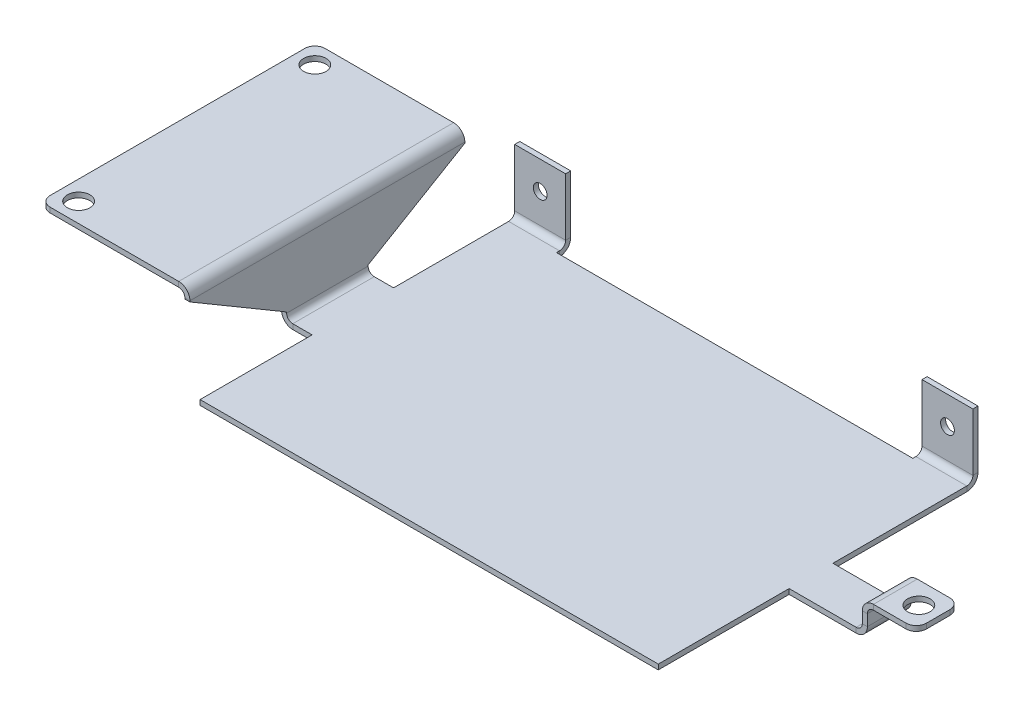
ISO-10303-21;
HEADER;
FILE_DESCRIPTION(('STEP AP214'),'2;1');
FILE_NAME('part.step','',(''),(''),'','','');
FILE_SCHEMA(('AUTOMOTIVE_DESIGN { 1 0 10303 214 1 1 1 1 }'));
ENDSEC;
DATA;
#1=APPLICATION_CONTEXT('core data for automotive mechanical design processes');
#2=APPLICATION_PROTOCOL_DEFINITION('international standard','automotive_design',2000,#1);
#3=PRODUCT_CONTEXT('',#1,'mechanical');
#4=PRODUCT('Part','Part','',(#3));
#5=PRODUCT_RELATED_PRODUCT_CATEGORY('part','',(#4));
#6=PRODUCT_DEFINITION_FORMATION('','',#4);
#7=PRODUCT_DEFINITION_CONTEXT('part definition',#1,'design');
#8=PRODUCT_DEFINITION('design','',#6,#7);
#9=PRODUCT_DEFINITION_SHAPE('','',#8);
#10=(LENGTH_UNIT() NAMED_UNIT(*) SI_UNIT(.MILLI.,.METRE.));
#11=(NAMED_UNIT(*) PLANE_ANGLE_UNIT() SI_UNIT($,.RADIAN.));
#12=(NAMED_UNIT(*) SI_UNIT($,.STERADIAN.) SOLID_ANGLE_UNIT());
#13=UNCERTAINTY_MEASURE_WITH_UNIT(LENGTH_MEASURE(1.E-05),#10,'distance_accuracy_value','');
#14=(GEOMETRIC_REPRESENTATION_CONTEXT(3) GLOBAL_UNCERTAINTY_ASSIGNED_CONTEXT((#13)) GLOBAL_UNIT_ASSIGNED_CONTEXT((#10,
#11,#12)) REPRESENTATION_CONTEXT('',''));
#15=CARTESIAN_POINT('',(0.,0.,0.));
#16=DIRECTION('',(0.,0.,1.));
#17=DIRECTION('',(1.,0.,0.));
#18=AXIS2_PLACEMENT_3D('',#15,#16,#17);
#19=CARTESIAN_POINT('',(56.816974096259,13.7160000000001,-28.956));
#20=DIRECTION('',(0.,0.,-1.));
#21=DIRECTION('',(-1.,0.,0.));
#22=AXIS2_PLACEMENT_3D('',#19,#20,#21);
#23=CYLINDRICAL_SURFACE('',#22,1.7272);
#24=CARTESIAN_POINT('',(56.816974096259,13.7160000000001,-40.386));
#25=DIRECTION('',(0.,0.,1.));
#26=DIRECTION('',(1.,0.,0.));
#27=AXIS2_PLACEMENT_3D('',#24,#25,#26);
#28=CIRCLE('',#27,1.7272);
#29=CARTESIAN_POINT('',(58.544174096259,13.7160000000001,-40.386));
#30=VERTEX_POINT('',#29);
#31=EDGE_CURVE('E758',#30,#30,#28,.F.);
#32=ORIENTED_EDGE('',*,*,#31,.F.);
#33=EDGE_LOOP('',(#32));
#34=FACE_BOUND('',#33,.T.);
#35=CARTESIAN_POINT('',(56.816974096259,13.7160000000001,-41.656));
#36=DIRECTION('',(0.,0.,1.));
#37=DIRECTION('',(1.,0.,0.));
#38=AXIS2_PLACEMENT_3D('',#35,#36,#37);
#39=CIRCLE('',#38,1.7272);
#40=CARTESIAN_POINT('',(58.544174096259,13.7160000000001,-41.656));
#41=VERTEX_POINT('',#40);
#42=EDGE_CURVE('E766',#41,#41,#39,.T.);
#43=ORIENTED_EDGE('',*,*,#42,.F.);
#44=EDGE_LOOP('',(#43));
#45=FACE_BOUND('',#44,.T.);
#46=ADVANCED_FACE('F26',(#34,#45),#23,.F.);
#47=CARTESIAN_POINT('',(50.466974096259,20.701,-2.05892335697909));
#48=DIRECTION('',(0.,1.,0.));
#49=DIRECTION('',(-1.,0.,0.));
#50=AXIS2_PLACEMENT_3D('',#47,#48,#49);
#51=PLANE('',#50);
#52=DIRECTION('',(0.,0.,-1.));
#53=VECTOR('',#52,1.);
#54=CARTESIAN_POINT('',(63.166974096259,20.701,-2.05892335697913));
#55=LINE('',#54,#53);
#56=CARTESIAN_POINT('',(63.166974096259,20.7010000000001,-40.3860000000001));
#57=VERTEX_POINT('',#56);
#58=CARTESIAN_POINT('',(63.166974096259,20.7010000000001,-41.6560000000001));
#59=VERTEX_POINT('',#58);
#60=EDGE_CURVE('E782',#57,#59,#55,.T.);
#61=ORIENTED_EDGE('',*,*,#60,.T.);
#62=DIRECTION('',(1.,0.,0.));
#63=VECTOR('',#62,1.);
#64=CARTESIAN_POINT('',(50.4669740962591,20.7010000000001,-41.656));
#65=LINE('',#64,#63);
#66=CARTESIAN_POINT('',(50.4669740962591,20.7010000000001,-41.656));
#67=VERTEX_POINT('',#66);
#68=EDGE_CURVE('E769',#67,#59,#65,.T.);
#69=ORIENTED_EDGE('',*,*,#68,.F.);
#70=DIRECTION('',(0.,0.,-1.));
#71=VECTOR('',#70,1.);
#72=CARTESIAN_POINT('',(50.466974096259,20.701,-2.05892335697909));
#73=LINE('',#72,#71);
#74=CARTESIAN_POINT('',(50.4669740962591,20.7010000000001,-40.386));
#75=VERTEX_POINT('',#74);
#76=EDGE_CURVE('E764',#75,#67,#73,.T.);
#77=ORIENTED_EDGE('',*,*,#76,.F.);
#78=DIRECTION('',(1.,0.,0.));
#79=VECTOR('',#78,1.);
#80=CARTESIAN_POINT('',(50.4669740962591,20.7010000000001,-40.386));
#81=LINE('',#80,#79);
#82=EDGE_CURVE('E780',#75,#57,#81,.T.);
#83=ORIENTED_EDGE('',*,*,#82,.T.);
#84=EDGE_LOOP('',(#61,#69,#77,#83));
#85=FACE_BOUND('',#84,.T.);
#86=ADVANCED_FACE('F1041',(#85),#51,.T.);
#87=CARTESIAN_POINT('',(63.166974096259,20.701,-2.05892335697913));
#88=DIRECTION('',(1.,0.,0.));
#89=DIRECTION('',(0.,1.,0.));
#90=AXIS2_PLACEMENT_3D('',#87,#88,#89);
#91=PLANE('',#90);
#92=DIRECTION('',(0.,0.,-1.));
#93=VECTOR('',#92,1.);
#94=CARTESIAN_POINT('',(63.166974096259,6.35,-2.05892335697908));
#95=LINE('',#94,#93);
#96=CARTESIAN_POINT('',(63.166974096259,6.35000000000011,-40.386));
#97=VERTEX_POINT('',#96);
#98=CARTESIAN_POINT('',(63.166974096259,6.35000000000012,-41.656));
#99=VERTEX_POINT('',#98);
#100=EDGE_CURVE('E342',#97,#99,#95,.T.);
#101=ORIENTED_EDGE('',*,*,#100,.T.);
#102=DIRECTION('',(0.,1.,0.));
#103=VECTOR('',#102,1.);
#104=CARTESIAN_POINT('',(63.166974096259,20.7010000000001,-41.6560000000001));
#105=LINE('',#104,#103);
#106=EDGE_CURVE('E777',#99,#59,#105,.T.);
#107=ORIENTED_EDGE('',*,*,#106,.T.);
#108=ORIENTED_EDGE('',*,*,#60,.F.);
#109=DIRECTION('',(0.,-1.,0.));
#110=VECTOR('',#109,1.);
#111=CARTESIAN_POINT('',(63.166974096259,20.7010000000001,-40.3860000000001));
#112=LINE('',#111,#110);
#113=EDGE_CURVE('E775',#57,#97,#112,.T.);
#114=ORIENTED_EDGE('',*,*,#113,.T.);
#115=EDGE_LOOP('',(#101,#107,#108,#114));
#116=FACE_BOUND('',#115,.T.);
#117=ADVANCED_FACE('F1047',(#116),#91,.T.);
#118=CARTESIAN_POINT('',(50.4669740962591,20.7010000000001,-41.656));
#119=DIRECTION('',(0.,0.,-1.));
#120=DIRECTION('',(-1.,0.,0.));
#121=AXIS2_PLACEMENT_3D('',#118,#119,#120);
#122=PLANE('',#121);
#123=DIRECTION('',(1.,0.,0.));
#124=VECTOR('',#123,1.);
#125=CARTESIAN_POINT('',(63.166974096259,6.35000000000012,-41.656));
#126=LINE('',#125,#124);
#127=CARTESIAN_POINT('',(50.4669740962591,6.35000000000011,-41.656));
#128=VERTEX_POINT('',#127);
#129=EDGE_CURVE('E633',#128,#99,#126,.T.);
#130=ORIENTED_EDGE('',*,*,#129,.F.);
#131=DIRECTION('',(0.,1.,0.));
#132=VECTOR('',#131,1.);
#133=CARTESIAN_POINT('',(50.4669740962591,20.7010000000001,-41.656));
#134=LINE('',#133,#132);
#135=EDGE_CURVE('E772',#128,#67,#134,.T.);
#136=ORIENTED_EDGE('',*,*,#135,.T.);
#137=ORIENTED_EDGE('',*,*,#68,.T.);
#138=ORIENTED_EDGE('',*,*,#106,.F.);
#139=EDGE_LOOP('',(#130,#136,#137,#138));
#140=FACE_BOUND('',#139,.T.);
#141=ORIENTED_EDGE('',*,*,#42,.T.);
#142=EDGE_LOOP('',(#141));
#143=FACE_BOUND('',#142,.T.);
#144=ADVANCED_FACE('F1058',(#140,#143),#122,.T.);
#145=CARTESIAN_POINT('',(50.466974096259,20.701,-2.05892335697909));
#146=DIRECTION('',(1.,0.,0.));
#147=DIRECTION('',(0.,1.,0.));
#148=AXIS2_PLACEMENT_3D('',#145,#146,#147);
#149=PLANE('',#148);
#150=ORIENTED_EDGE('',*,*,#135,.F.);
#151=DIRECTION('',(0.,0.,-1.));
#152=VECTOR('',#151,1.);
#153=CARTESIAN_POINT('',(50.466974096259,6.35,-2.05892335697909));
#154=LINE('',#153,#152);
#155=CARTESIAN_POINT('',(50.4669740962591,6.35000000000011,-40.386));
#156=VERTEX_POINT('',#155);
#157=EDGE_CURVE('E628',#156,#128,#154,.T.);
#158=ORIENTED_EDGE('',*,*,#157,.F.);
#159=DIRECTION('',(0.,-1.,0.));
#160=VECTOR('',#159,1.);
#161=CARTESIAN_POINT('',(50.4669740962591,20.7010000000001,-40.386));
#162=LINE('',#161,#160);
#163=EDGE_CURVE('E762',#75,#156,#162,.T.);
#164=ORIENTED_EDGE('',*,*,#163,.F.);
#165=ORIENTED_EDGE('',*,*,#76,.T.);
#166=EDGE_LOOP('',(#150,#158,#164,#165));
#167=FACE_BOUND('',#166,.T.);
#168=ADVANCED_FACE('F1061',(#167),#149,.F.);
#169=CARTESIAN_POINT('',(50.4669740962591,20.7010000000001,-40.386));
#170=DIRECTION('',(0.,0.,1.));
#171=DIRECTION('',(1.,0.,0.));
#172=AXIS2_PLACEMENT_3D('',#169,#170,#171);
#173=PLANE('',#172);
#174=DIRECTION('',(-1.,0.,0.));
#175=VECTOR('',#174,1.);
#176=CARTESIAN_POINT('',(63.166974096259,6.35000000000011,-40.386));
#177=LINE('',#176,#175);
#178=EDGE_CURVE('E722',#97,#156,#177,.T.);
#179=ORIENTED_EDGE('',*,*,#178,.F.);
#180=ORIENTED_EDGE('',*,*,#113,.F.);
#181=ORIENTED_EDGE('',*,*,#82,.F.);
#182=ORIENTED_EDGE('',*,*,#163,.T.);
#183=EDGE_LOOP('',(#179,#180,#181,#182));
#184=FACE_BOUND('',#183,.T.);
#185=ORIENTED_EDGE('',*,*,#31,.T.);
#186=EDGE_LOOP('',(#185));
#187=FACE_BOUND('',#186,.T.);
#188=ADVANCED_FACE('F28',(#184,#187),#173,.T.);
#189=CARTESIAN_POINT('',(-44.7830259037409,13.7160000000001,-28.956));
#190=DIRECTION('',(0.,0.,-1.));
#191=DIRECTION('',(-1.,0.,0.));
#192=AXIS2_PLACEMENT_3D('',#189,#190,#191);
#193=CYLINDRICAL_SURFACE('',#192,1.7272);
#194=CARTESIAN_POINT('',(-44.7830259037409,13.7160000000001,-40.386));
#195=DIRECTION('',(0.,0.,1.));
#196=DIRECTION('',(1.,0.,0.));
#197=AXIS2_PLACEMENT_3D('',#194,#195,#196);
#198=CIRCLE('',#197,1.7272);
#199=CARTESIAN_POINT('',(-43.0558259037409,13.7160000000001,-40.386));
#200=VERTEX_POINT('',#199);
#201=EDGE_CURVE('E719',#200,#200,#198,.F.);
#202=ORIENTED_EDGE('',*,*,#201,.F.);
#203=EDGE_LOOP('',(#202));
#204=FACE_BOUND('',#203,.T.);
#205=CARTESIAN_POINT('',(-44.7830259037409,13.7160000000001,-41.656));
#206=DIRECTION('',(0.,0.,1.));
#207=DIRECTION('',(1.,0.,0.));
#208=AXIS2_PLACEMENT_3D('',#205,#206,#207);
#209=CIRCLE('',#208,1.7272);
#210=CARTESIAN_POINT('',(-43.0558259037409,13.7160000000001,-41.656));
#211=VERTEX_POINT('',#210);
#212=EDGE_CURVE('E736',#211,#211,#209,.T.);
#213=ORIENTED_EDGE('',*,*,#212,.F.);
#214=EDGE_LOOP('',(#213));
#215=FACE_BOUND('',#214,.T.);
#216=ADVANCED_FACE('F1068',(#204,#215),#193,.F.);
#217=CARTESIAN_POINT('',(-38.433025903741,20.701,-2.0589233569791));
#218=DIRECTION('',(0.,-1.,0.));
#219=DIRECTION('',(1.,0.,0.));
#220=AXIS2_PLACEMENT_3D('',#217,#218,#219);
#221=PLANE('',#220);
#222=DIRECTION('',(-1.,0.,0.));
#223=VECTOR('',#222,1.);
#224=CARTESIAN_POINT('',(-38.4330259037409,20.7010000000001,-41.6560000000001));
#225=LINE('',#224,#223);
#226=CARTESIAN_POINT('',(-38.4330259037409,20.7010000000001,-41.6560000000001));
#227=VERTEX_POINT('',#226);
#228=CARTESIAN_POINT('',(-51.133025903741,20.7010000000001,-41.6560000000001));
#229=VERTEX_POINT('',#228);
#230=EDGE_CURVE('E747',#227,#229,#225,.T.);
#231=ORIENTED_EDGE('',*,*,#230,.T.);
#232=DIRECTION('',(0.,0.,-1.));
#233=VECTOR('',#232,1.);
#234=CARTESIAN_POINT('',(-51.133025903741,20.7009999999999,-2.0589233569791));
#235=LINE('',#234,#233);
#236=CARTESIAN_POINT('',(-51.133025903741,20.701,-40.3860000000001));
#237=VERTEX_POINT('',#236);
#238=EDGE_CURVE('E733',#237,#229,#235,.T.);
#239=ORIENTED_EDGE('',*,*,#238,.F.);
#240=DIRECTION('',(-1.,0.,0.));
#241=VECTOR('',#240,1.);
#242=CARTESIAN_POINT('',(-38.4330259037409,20.7010000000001,-40.3860000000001));
#243=LINE('',#242,#241);
#244=CARTESIAN_POINT('',(-38.4330259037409,20.7010000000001,-40.3860000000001));
#245=VERTEX_POINT('',#244);
#246=EDGE_CURVE('E723',#245,#237,#243,.T.);
#247=ORIENTED_EDGE('',*,*,#246,.F.);
#248=DIRECTION('',(0.,0.,-1.));
#249=VECTOR('',#248,1.);
#250=CARTESIAN_POINT('',(-38.433025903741,20.701,-2.0589233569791));
#251=LINE('',#250,#249);
#252=EDGE_CURVE('E744',#245,#227,#251,.T.);
#253=ORIENTED_EDGE('',*,*,#252,.T.);
#254=EDGE_LOOP('',(#231,#239,#247,#253));
#255=FACE_BOUND('',#254,.T.);
#256=ADVANCED_FACE('F1082',(#255),#221,.F.);
#257=CARTESIAN_POINT('',(-38.433025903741,20.701,-2.0589233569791));
#258=DIRECTION('',(-1.,0.,0.));
#259=DIRECTION('',(0.,0.,-1.));
#260=AXIS2_PLACEMENT_3D('',#257,#258,#259);
#261=PLANE('',#260);
#262=DIRECTION('',(0.,-1.,0.));
#263=VECTOR('',#262,1.);
#264=CARTESIAN_POINT('',(-38.4330259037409,20.7010000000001,-41.6560000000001));
#265=LINE('',#264,#263);
#266=CARTESIAN_POINT('',(-38.433025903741,6.35000000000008,-41.656));
#267=VERTEX_POINT('',#266);
#268=EDGE_CURVE('E739',#227,#267,#265,.T.);
#269=ORIENTED_EDGE('',*,*,#268,.F.);
#270=ORIENTED_EDGE('',*,*,#252,.F.);
#271=DIRECTION('',(0.,1.,0.));
#272=VECTOR('',#271,1.);
#273=CARTESIAN_POINT('',(-38.4330259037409,20.7010000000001,-40.3860000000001));
#274=LINE('',#273,#272);
#275=CARTESIAN_POINT('',(-38.4330259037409,6.35000000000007,-40.386));
#276=VERTEX_POINT('',#275);
#277=EDGE_CURVE('E725',#276,#245,#274,.T.);
#278=ORIENTED_EDGE('',*,*,#277,.F.);
#279=DIRECTION('',(0.,0.,-1.));
#280=VECTOR('',#279,1.);
#281=CARTESIAN_POINT('',(-38.433025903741,6.34999999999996,-2.0589233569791));
#282=LINE('',#281,#280);
#283=EDGE_CURVE('E742',#276,#267,#282,.T.);
#284=ORIENTED_EDGE('',*,*,#283,.T.);
#285=EDGE_LOOP('',(#269,#270,#278,#284));
#286=FACE_BOUND('',#285,.T.);
#287=ADVANCED_FACE('F1088',(#286),#261,.F.);
#288=CARTESIAN_POINT('',(-38.4330259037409,20.7010000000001,-41.6560000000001));
#289=DIRECTION('',(0.,0.,-1.));
#290=DIRECTION('',(-1.,0.,0.));
#291=AXIS2_PLACEMENT_3D('',#288,#289,#290);
#292=PLANE('',#291);
#293=DIRECTION('',(1.,0.,0.));
#294=VECTOR('',#293,1.);
#295=CARTESIAN_POINT('',(-38.4330259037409,6.35000000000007,-41.656));
#296=LINE('',#295,#294);
#297=CARTESIAN_POINT('',(-51.133025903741,6.35000000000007,-41.656));
#298=VERTEX_POINT('',#297);
#299=EDGE_CURVE('E750',#298,#267,#296,.T.);
#300=ORIENTED_EDGE('',*,*,#299,.F.);
#301=DIRECTION('',(0.,-1.,0.));
#302=VECTOR('',#301,1.);
#303=CARTESIAN_POINT('',(-51.133025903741,20.7010000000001,-41.6560000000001));
#304=LINE('',#303,#302);
#305=EDGE_CURVE('E730',#229,#298,#304,.T.);
#306=ORIENTED_EDGE('',*,*,#305,.F.);
#307=ORIENTED_EDGE('',*,*,#230,.F.);
#308=ORIENTED_EDGE('',*,*,#268,.T.);
#309=EDGE_LOOP('',(#300,#306,#307,#308));
#310=FACE_BOUND('',#309,.T.);
#311=ORIENTED_EDGE('',*,*,#212,.T.);
#312=EDGE_LOOP('',(#311));
#313=FACE_BOUND('',#312,.T.);
#314=ADVANCED_FACE('F1098',(#310,#313),#292,.T.);
#315=CARTESIAN_POINT('',(-51.133025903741,20.7009999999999,-2.0589233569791));
#316=DIRECTION('',(-1.,0.,0.));
#317=DIRECTION('',(0.,0.,-1.));
#318=AXIS2_PLACEMENT_3D('',#315,#316,#317);
#319=PLANE('',#318);
#320=ORIENTED_EDGE('',*,*,#238,.T.);
#321=ORIENTED_EDGE('',*,*,#305,.T.);
#322=DIRECTION('',(0.,0.,-1.));
#323=VECTOR('',#322,1.);
#324=CARTESIAN_POINT('',(-51.133025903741,6.34999999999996,-2.05892335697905));
#325=LINE('',#324,#323);
#326=CARTESIAN_POINT('',(-51.133025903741,6.35000000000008,-40.386));
#327=VERTEX_POINT('',#326);
#328=EDGE_CURVE('E753',#327,#298,#325,.T.);
#329=ORIENTED_EDGE('',*,*,#328,.F.);
#330=DIRECTION('',(0.,1.,0.));
#331=VECTOR('',#330,1.);
#332=CARTESIAN_POINT('',(-51.133025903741,20.701,-40.3860000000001));
#333=LINE('',#332,#331);
#334=EDGE_CURVE('E727',#327,#237,#333,.T.);
#335=ORIENTED_EDGE('',*,*,#334,.T.);
#336=EDGE_LOOP('',(#320,#321,#329,#335));
#337=FACE_BOUND('',#336,.T.);
#338=ADVANCED_FACE('F1101',(#337),#319,.T.);
#339=CARTESIAN_POINT('',(-38.4330259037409,20.7010000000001,-40.3860000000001));
#340=DIRECTION('',(0.,0.,1.));
#341=DIRECTION('',(1.,0.,0.));
#342=AXIS2_PLACEMENT_3D('',#339,#340,#341);
#343=PLANE('',#342);
#344=DIRECTION('',(-1.,0.,0.));
#345=VECTOR('',#344,1.);
#346=CARTESIAN_POINT('',(-38.4330259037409,6.35000000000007,-40.386));
#347=LINE('',#346,#345);
#348=EDGE_CURVE('E687',#276,#327,#347,.T.);
#349=ORIENTED_EDGE('',*,*,#348,.F.);
#350=ORIENTED_EDGE('',*,*,#277,.T.);
#351=ORIENTED_EDGE('',*,*,#246,.T.);
#352=ORIENTED_EDGE('',*,*,#334,.F.);
#353=EDGE_LOOP('',(#349,#350,#351,#352));
#354=FACE_BOUND('',#353,.T.);
#355=ORIENTED_EDGE('',*,*,#201,.T.);
#356=EDGE_LOOP('',(#355));
#357=FACE_BOUND('',#356,.T.);
#358=ADVANCED_FACE('F1053',(#354,#357),#343,.T.);
#359=CARTESIAN_POINT('',(90.0747500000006,3.55595000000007,0.));
#360=DIRECTION('',(0.,1.,0.));
#361=DIRECTION('',(-1.,0.,0.));
#362=AXIS2_PLACEMENT_3D('',#359,#360,#361);
#363=CYLINDRICAL_SURFACE('',#362,2.8067);
#364=CARTESIAN_POINT('',(90.0747500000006,11.9380000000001,0.));
#365=DIRECTION('',(0.,1.,0.));
#366=DIRECTION('',(-1.,0.,0.));
#367=AXIS2_PLACEMENT_3D('',#364,#365,#366);
#368=CIRCLE('',#367,2.8067);
#369=CARTESIAN_POINT('',(87.2680500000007,11.9380000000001,0.));
#370=VERTEX_POINT('',#369);
#371=EDGE_CURVE('E712',#370,#370,#368,.T.);
#372=ORIENTED_EDGE('',*,*,#371,.T.);
#373=EDGE_LOOP('',(#372));
#374=FACE_BOUND('',#373,.T.);
#375=CARTESIAN_POINT('',(90.0747500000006,10.6680000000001,0.));
#376=DIRECTION('',(0.,1.,0.));
#377=DIRECTION('',(-1.,0.,0.));
#378=AXIS2_PLACEMENT_3D('',#375,#376,#377);
#379=CIRCLE('',#378,2.8067);
#380=CARTESIAN_POINT('',(87.2680500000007,10.6680000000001,0.));
#381=VERTEX_POINT('',#380);
#382=EDGE_CURVE('E693',#381,#381,#379,.T.);
#383=ORIENTED_EDGE('',*,*,#382,.F.);
#384=EDGE_LOOP('',(#383));
#385=FACE_BOUND('',#384,.T.);
#386=ADVANCED_FACE('F1108',(#374,#385),#363,.F.);
#387=CARTESIAN_POINT('',(94.8800000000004,-18.5969837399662,5.46100000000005));
#388=DIRECTION('',(1.,0.,0.));
#389=DIRECTION('',(0.,1.,0.));
#390=AXIS2_PLACEMENT_3D('',#387,#388,#389);
#391=PLANE('',#390);
#392=DIRECTION('',(0.,0.,-1.));
#393=VECTOR('',#392,1.);
#394=CARTESIAN_POINT('',(94.8800000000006,10.668,5.46099999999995));
#395=LINE('',#394,#393);
#396=CARTESIAN_POINT('',(94.8800000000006,10.668,2.92099999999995));
#397=VERTEX_POINT('',#396);
#398=CARTESIAN_POINT('',(94.8800000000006,10.668,-2.92100000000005));
#399=VERTEX_POINT('',#398);
#400=EDGE_CURVE('E709',#397,#399,#395,.T.);
#401=ORIENTED_EDGE('',*,*,#400,.T.);
#402=DIRECTION('',(0.,1.,0.));
#403=VECTOR('',#402,1.);
#404=CARTESIAN_POINT('',(94.8800000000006,11.938,-2.92100000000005));
#405=LINE('',#404,#403);
#406=CARTESIAN_POINT('',(94.8800000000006,11.938,-2.92100000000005));
#407=VERTEX_POINT('',#406);
#408=EDGE_CURVE('E807',#399,#407,#405,.T.);
#409=ORIENTED_EDGE('',*,*,#408,.T.);
#410=DIRECTION('',(0.,0.,-1.));
#411=VECTOR('',#410,1.);
#412=CARTESIAN_POINT('',(94.8800000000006,11.938,5.46099999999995));
#413=LINE('',#412,#411);
#414=CARTESIAN_POINT('',(94.8800000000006,11.938,2.92099999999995));
#415=VERTEX_POINT('',#414);
#416=EDGE_CURVE('E698',#415,#407,#413,.T.);
#417=ORIENTED_EDGE('',*,*,#416,.F.);
#418=DIRECTION('',(0.,1.,0.));
#419=VECTOR('',#418,1.);
#420=CARTESIAN_POINT('',(94.8800000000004,-18.5969837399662,2.92100000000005));
#421=LINE('',#420,#419);
#422=EDGE_CURVE('E805',#415,#397,#421,.F.);
#423=ORIENTED_EDGE('',*,*,#422,.T.);
#424=EDGE_LOOP('',(#401,#409,#417,#423));
#425=FACE_BOUND('',#424,.T.);
#426=ADVANCED_FACE('F820',(#425),#391,.T.);
#427=CARTESIAN_POINT('',(94.8800000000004,-18.5969837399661,-5.46099999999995));
#428=DIRECTION('',(0.,0.,1.));
#429=DIRECTION('',(1.,0.,0.));
#430=AXIS2_PLACEMENT_3D('',#427,#428,#429);
#431=PLANE('',#430);
#432=DIRECTION('',(-1.,0.,0.));
#433=VECTOR('',#432,1.);
#434=CARTESIAN_POINT('',(94.8800000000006,11.938,-5.46100000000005));
#435=LINE('',#434,#433);
#436=CARTESIAN_POINT('',(92.3400000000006,11.9380000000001,-5.46100000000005));
#437=VERTEX_POINT('',#436);
#438=CARTESIAN_POINT('',(84.2120000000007,11.9380000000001,-5.46100000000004));
#439=VERTEX_POINT('',#438);
#440=EDGE_CURVE('E704',#437,#439,#435,.T.);
#441=ORIENTED_EDGE('',*,*,#440,.F.);
#442=DIRECTION('',(0.,1.,0.));
#443=VECTOR('',#442,1.);
#444=CARTESIAN_POINT('',(92.3400000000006,10.6680000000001,-5.46100000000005));
#445=LINE('',#444,#443);
#446=CARTESIAN_POINT('',(92.3400000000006,10.6680000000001,-5.46100000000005));
#447=VERTEX_POINT('',#446);
#448=EDGE_CURVE('E49',#437,#447,#445,.F.);
#449=ORIENTED_EDGE('',*,*,#448,.T.);
#450=DIRECTION('',(1.,0.,0.));
#451=VECTOR('',#450,1.);
#452=CARTESIAN_POINT('',(94.8800000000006,10.6680000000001,-5.46100000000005));
#453=LINE('',#452,#451);
#454=CARTESIAN_POINT('',(84.2120000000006,10.6680000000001,-5.46100000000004));
#455=VERTEX_POINT('',#454);
#456=EDGE_CURVE('E685',#455,#447,#453,.T.);
#457=ORIENTED_EDGE('',*,*,#456,.F.);
#458=DIRECTION('',(0.,1.,0.));
#459=VECTOR('',#458,1.);
#460=CARTESIAN_POINT('',(84.2120000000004,-18.596983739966,-5.46099999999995));
#461=LINE('',#460,#459);
#462=EDGE_CURVE('E706',#455,#439,#461,.T.);
#463=ORIENTED_EDGE('',*,*,#462,.T.);
#464=EDGE_LOOP('',(#441,#449,#457,#463));
#465=FACE_BOUND('',#464,.T.);
#466=ADVANCED_FACE('F826',(#465),#431,.F.);
#467=CARTESIAN_POINT('',(94.8800000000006,11.938,5.46099999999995));
#468=DIRECTION('',(0.,-1.,0.));
#469=DIRECTION('',(1.,0.,0.));
#470=AXIS2_PLACEMENT_3D('',#467,#468,#469);
#471=PLANE('',#470);
#472=ORIENTED_EDGE('',*,*,#371,.F.);
#473=EDGE_LOOP('',(#472));
#474=FACE_BOUND('',#473,.T.);
#475=ORIENTED_EDGE('',*,*,#416,.T.);
#476=CARTESIAN_POINT('',(92.3400000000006,11.9380000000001,-2.92100000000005));
#477=DIRECTION('',(0.,-1.,0.));
#478=DIRECTION('',(1.,0.,0.));
#479=AXIS2_PLACEMENT_3D('',#476,#477,#478);
#480=CIRCLE('',#479,2.54);
#481=EDGE_CURVE('E812',#407,#437,#480,.F.);
#482=ORIENTED_EDGE('',*,*,#481,.T.);
#483=ORIENTED_EDGE('',*,*,#440,.T.);
#484=DIRECTION('',(0.,0.,1.));
#485=VECTOR('',#484,1.);
#486=CARTESIAN_POINT('',(84.2120000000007,11.9380000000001,-5.46100000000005));
#487=LINE('',#486,#485);
#488=CARTESIAN_POINT('',(84.2120000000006,11.9380000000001,5.46099999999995));
#489=VERTEX_POINT('',#488);
#490=EDGE_CURVE('E701',#439,#489,#487,.T.);
#491=ORIENTED_EDGE('',*,*,#490,.T.);
#492=DIRECTION('',(-1.,0.,0.));
#493=VECTOR('',#492,1.);
#494=CARTESIAN_POINT('',(94.8800000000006,11.938,5.46099999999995));
#495=LINE('',#494,#493);
#496=CARTESIAN_POINT('',(92.3400000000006,11.938,5.46099999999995));
#497=VERTEX_POINT('',#496);
#498=EDGE_CURVE('E696',#497,#489,#495,.T.);
#499=ORIENTED_EDGE('',*,*,#498,.F.);
#500=CARTESIAN_POINT('',(92.3400000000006,11.938,2.92099999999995));
#501=DIRECTION('',(0.,-1.,0.));
#502=DIRECTION('',(1.,0.,0.));
#503=AXIS2_PLACEMENT_3D('',#500,#501,#502);
#504=CIRCLE('',#503,2.54);
#505=EDGE_CURVE('E810',#497,#415,#504,.F.);
#506=ORIENTED_EDGE('',*,*,#505,.T.);
#507=EDGE_LOOP('',(#475,#482,#483,#491,#499,#506));
#508=FACE_BOUND('',#507,.T.);
#509=ADVANCED_FACE('F825',(#474,#508),#471,.F.);
#510=CARTESIAN_POINT('',(94.8800000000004,-18.5969837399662,5.46100000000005));
#511=DIRECTION('',(0.,0.,1.));
#512=DIRECTION('',(1.,0.,0.));
#513=AXIS2_PLACEMENT_3D('',#510,#511,#512);
#514=PLANE('',#513);
#515=DIRECTION('',(-1.,0.,0.));
#516=VECTOR('',#515,1.);
#517=CARTESIAN_POINT('',(94.8800000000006,10.668,5.46099999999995));
#518=LINE('',#517,#516);
#519=CARTESIAN_POINT('',(92.3400000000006,10.668,5.46099999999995));
#520=VERTEX_POINT('',#519);
#521=CARTESIAN_POINT('',(84.2120000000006,10.6680000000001,5.46099999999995));
#522=VERTEX_POINT('',#521);
#523=EDGE_CURVE('E691',#520,#522,#518,.T.);
#524=ORIENTED_EDGE('',*,*,#523,.F.);
#525=DIRECTION('',(0.,1.,0.));
#526=VECTOR('',#525,1.);
#527=CARTESIAN_POINT('',(92.3400000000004,-18.5969837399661,5.46100000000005));
#528=LINE('',#527,#526);
#529=EDGE_CURVE('E11',#520,#497,#528,.T.);
#530=ORIENTED_EDGE('',*,*,#529,.T.);
#531=ORIENTED_EDGE('',*,*,#498,.T.);
#532=DIRECTION('',(0.,1.,0.));
#533=VECTOR('',#532,1.);
#534=CARTESIAN_POINT('',(84.2120000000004,-18.5969837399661,5.46100000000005));
#535=LINE('',#534,#533);
#536=EDGE_CURVE('E715',#522,#489,#535,.T.);
#537=ORIENTED_EDGE('',*,*,#536,.F.);
#538=EDGE_LOOP('',(#524,#530,#531,#537));
#539=FACE_BOUND('',#538,.T.);
#540=ADVANCED_FACE('F1029',(#539),#514,.T.);
#541=CARTESIAN_POINT('',(94.8800000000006,10.668,5.46099999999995));
#542=DIRECTION('',(0.,1.,0.));
#543=DIRECTION('',(-1.,0.,0.));
#544=AXIS2_PLACEMENT_3D('',#541,#542,#543);
#545=PLANE('',#544);
#546=ORIENTED_EDGE('',*,*,#382,.T.);
#547=EDGE_LOOP('',(#546));
#548=FACE_BOUND('',#547,.T.);
#549=ORIENTED_EDGE('',*,*,#456,.T.);
#550=CARTESIAN_POINT('',(92.3400000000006,10.6680000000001,-2.92100000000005));
#551=DIRECTION('',(0.,1.,0.));
#552=DIRECTION('',(-1.,0.,0.));
#553=AXIS2_PLACEMENT_3D('',#550,#551,#552);
#554=CIRCLE('',#553,2.54);
#555=EDGE_CURVE('E34',#447,#399,#554,.F.);
#556=ORIENTED_EDGE('',*,*,#555,.T.);
#557=ORIENTED_EDGE('',*,*,#400,.F.);
#558=CARTESIAN_POINT('',(92.3400000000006,10.668,2.92099999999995));
#559=DIRECTION('',(0.,1.,0.));
#560=DIRECTION('',(-1.,0.,0.));
#561=AXIS2_PLACEMENT_3D('',#558,#559,#560);
#562=CIRCLE('',#561,2.54);
#563=EDGE_CURVE('E41',#397,#520,#562,.F.);
#564=ORIENTED_EDGE('',*,*,#563,.T.);
#565=ORIENTED_EDGE('',*,*,#523,.T.);
#566=DIRECTION('',(0.,0.,-1.));
#567=VECTOR('',#566,1.);
#568=CARTESIAN_POINT('',(84.2120000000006,10.6680000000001,-5.46100000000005));
#569=LINE('',#568,#567);
#570=EDGE_CURVE('E688',#522,#455,#569,.T.);
#571=ORIENTED_EDGE('',*,*,#570,.T.);
#572=EDGE_LOOP('',(#549,#556,#557,#564,#565,#571));
#573=FACE_BOUND('',#572,.T.);
#574=ADVANCED_FACE('F816',(#548,#573),#545,.F.);
#575=CARTESIAN_POINT('',(58.8705815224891,11.938,5.46099999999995));
#576=DIRECTION('',(0.,0.,1.));
#577=DIRECTION('',(0.,1.,0.));
#578=AXIS2_PLACEMENT_3D('',#575,#576,#577);
#579=PLANE('',#578);
#580=DIRECTION('',(0.,-1.,0.));
#581=VECTOR('',#580,1.);
#582=CARTESIAN_POINT('',(82.688,11.9380000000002,5.46099999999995));
#583=LINE('',#582,#581);
#584=CARTESIAN_POINT('',(82.6880000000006,9.14400000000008,5.46099999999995));
#585=VERTEX_POINT('',#584);
#586=CARTESIAN_POINT('',(82.688,6.35,5.46099999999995));
#587=VERTEX_POINT('',#586);
#588=EDGE_CURVE('E671',#585,#587,#583,.T.);
#589=ORIENTED_EDGE('',*,*,#588,.F.);
#590=DIRECTION('',(1.,0.,0.));
#591=VECTOR('',#590,1.);
#592=CARTESIAN_POINT('',(58.8705815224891,9.14400000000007,5.46099999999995));
#593=LINE('',#592,#591);
#594=CARTESIAN_POINT('',(81.4180000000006,9.14400000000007,5.46099999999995));
#595=VERTEX_POINT('',#594);
#596=EDGE_CURVE('E660',#595,#585,#593,.T.);
#597=ORIENTED_EDGE('',*,*,#596,.F.);
#598=DIRECTION('',(0.,1.,0.));
#599=VECTOR('',#598,1.);
#600=CARTESIAN_POINT('',(81.418,11.938,5.46099999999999));
#601=LINE('',#600,#599);
#602=CARTESIAN_POINT('',(81.418,6.35000000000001,5.46099999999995));
#603=VERTEX_POINT('',#602);
#604=EDGE_CURVE('E844',#603,#595,#601,.T.);
#605=ORIENTED_EDGE('',*,*,#604,.F.);
#606=DIRECTION('',(1.,0.,0.));
#607=VECTOR('',#606,1.);
#608=CARTESIAN_POINT('',(58.8705815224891,6.35,5.46099999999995));
#609=LINE('',#608,#607);
#610=EDGE_CURVE('E677',#603,#587,#609,.T.);
#611=ORIENTED_EDGE('',*,*,#610,.T.);
#612=EDGE_LOOP('',(#589,#597,#605,#611));
#613=FACE_BOUND('',#612,.T.);
#614=ADVANCED_FACE('F839',(#613),#579,.T.);
#615=CARTESIAN_POINT('',(82.688,10.668,5.46099999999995));
#616=DIRECTION('',(-1.,0.,0.));
#617=DIRECTION('',(0.,-1.,0.));
#618=AXIS2_PLACEMENT_3D('',#615,#616,#617);
#619=PLANE('',#618);
#620=DIRECTION('',(0.,1.,0.));
#621=VECTOR('',#620,1.);
#622=CARTESIAN_POINT('',(82.688,10.668,-5.46100000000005));
#623=LINE('',#622,#621);
#624=CARTESIAN_POINT('',(82.688,6.35000000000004,-5.46100000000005));
#625=VERTEX_POINT('',#624);
#626=CARTESIAN_POINT('',(82.688,9.14400000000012,-5.46100000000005));
#627=VERTEX_POINT('',#626);
#628=EDGE_CURVE('E669',#625,#627,#623,.T.);
#629=ORIENTED_EDGE('',*,*,#628,.T.);
#630=DIRECTION('',(0.,0.,1.));
#631=VECTOR('',#630,1.);
#632=CARTESIAN_POINT('',(82.688,9.14400000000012,-5.46100000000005));
#633=LINE('',#632,#631);
#634=EDGE_CURVE('E676',#627,#585,#633,.T.);
#635=ORIENTED_EDGE('',*,*,#634,.T.);
#636=ORIENTED_EDGE('',*,*,#588,.T.);
#637=DIRECTION('',(0.,0.,-1.));
#638=VECTOR('',#637,1.);
#639=CARTESIAN_POINT('',(82.688,6.35000000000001,5.46099999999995));
#640=LINE('',#639,#638);
#641=EDGE_CURVE('E666',#587,#625,#640,.T.);
#642=ORIENTED_EDGE('',*,*,#641,.T.);
#643=EDGE_LOOP('',(#629,#635,#636,#642));
#644=FACE_BOUND('',#643,.T.);
#645=ADVANCED_FACE('F667',(#644),#619,.F.);
#646=CARTESIAN_POINT('',(58.8705815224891,11.938,-5.46100000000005));
#647=DIRECTION('',(0.,0.,1.));
#648=DIRECTION('',(0.,1.,0.));
#649=AXIS2_PLACEMENT_3D('',#646,#647,#648);
#650=PLANE('',#649);
#651=DIRECTION('',(1.,0.,0.));
#652=VECTOR('',#651,1.);
#653=CARTESIAN_POINT('',(58.8705815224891,9.1440000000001,-5.46100000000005));
#654=LINE('',#653,#652);
#655=CARTESIAN_POINT('',(81.4180000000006,9.14400000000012,-5.46100000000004));
#656=VERTEX_POINT('',#655);
#657=EDGE_CURVE('E672',#656,#627,#654,.T.);
#658=ORIENTED_EDGE('',*,*,#657,.T.);
#659=ORIENTED_EDGE('',*,*,#628,.F.);
#660=DIRECTION('',(1.,0.,0.));
#661=VECTOR('',#660,1.);
#662=CARTESIAN_POINT('',(58.8705815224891,6.35000000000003,-5.46100000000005));
#663=LINE('',#662,#661);
#664=CARTESIAN_POINT('',(81.418,6.35000000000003,-5.46100000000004));
#665=VERTEX_POINT('',#664);
#666=EDGE_CURVE('E654',#665,#625,#663,.T.);
#667=ORIENTED_EDGE('',*,*,#666,.F.);
#668=DIRECTION('',(0.,-1.,0.));
#669=VECTOR('',#668,1.);
#670=CARTESIAN_POINT('',(81.418,11.9380000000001,-5.461));
#671=LINE('',#670,#669);
#672=EDGE_CURVE('E849',#656,#665,#671,.T.);
#673=ORIENTED_EDGE('',*,*,#672,.F.);
#674=EDGE_LOOP('',(#658,#659,#667,#673));
#675=FACE_BOUND('',#674,.T.);
#676=ADVANCED_FACE('F675',(#675),#650,.F.);
#677=CARTESIAN_POINT('',(81.418,11.938,5.46099999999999));
#678=DIRECTION('',(1.,0.,0.));
#679=DIRECTION('',(0.,0.,-1.));
#680=AXIS2_PLACEMENT_3D('',#677,#678,#679);
#681=PLANE('',#680);
#682=ORIENTED_EDGE('',*,*,#604,.T.);
#683=DIRECTION('',(0.,0.,-1.));
#684=VECTOR('',#683,1.);
#685=CARTESIAN_POINT('',(81.418,9.14400000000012,-5.46100000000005));
#686=LINE('',#685,#684);
#687=EDGE_CURVE('E846',#595,#656,#686,.T.);
#688=ORIENTED_EDGE('',*,*,#687,.T.);
#689=ORIENTED_EDGE('',*,*,#672,.T.);
#690=DIRECTION('',(0.,0.,1.));
#691=VECTOR('',#690,1.);
#692=CARTESIAN_POINT('',(81.418,6.35000000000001,5.46099999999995));
#693=LINE('',#692,#691);
#694=EDGE_CURVE('E718',#665,#603,#693,.T.);
#695=ORIENTED_EDGE('',*,*,#694,.T.);
#696=EDGE_LOOP('',(#682,#688,#689,#695));
#697=FACE_BOUND('',#696,.T.);
#698=ADVANCED_FACE('F1021',(#697),#681,.F.);
#699=CARTESIAN_POINT('',(-90.07475,3.55594999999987,29.4639999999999));
#700=DIRECTION('',(0.,1.,0.));
#701=DIRECTION('',(0.,0.,1.));
#702=AXIS2_PLACEMENT_3D('',#699,#700,#701);
#703=CYLINDRICAL_SURFACE('',#702,2.8067);
#704=CARTESIAN_POINT('',(-90.07475,23.8759999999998,29.464));
#705=DIRECTION('',(0.,1.,0.));
#706=DIRECTION('',(0.,0.,1.));
#707=AXIS2_PLACEMENT_3D('',#704,#705,#706);
#708=CIRCLE('',#707,2.8067);
#709=CARTESIAN_POINT('',(-90.07475,23.8759999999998,32.2707));
#710=VERTEX_POINT('',#709);
#711=EDGE_CURVE('E856',#710,#710,#708,.T.);
#712=ORIENTED_EDGE('',*,*,#711,.T.);
#713=EDGE_LOOP('',(#712));
#714=FACE_BOUND('',#713,.T.);
#715=CARTESIAN_POINT('',(-90.07475,22.6059999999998,29.464));
#716=DIRECTION('',(0.,1.,0.));
#717=DIRECTION('',(0.,0.,1.));
#718=AXIS2_PLACEMENT_3D('',#715,#716,#717);
#719=CIRCLE('',#718,2.8067);
#720=CARTESIAN_POINT('',(-90.07475,22.6059999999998,32.2707));
#721=VERTEX_POINT('',#720);
#722=EDGE_CURVE('E881',#721,#721,#719,.T.);
#723=ORIENTED_EDGE('',*,*,#722,.F.);
#724=EDGE_LOOP('',(#723));
#725=FACE_BOUND('',#724,.T.);
#726=ADVANCED_FACE('F1171',(#714,#725),#703,.F.);
#727=CARTESIAN_POINT('',(-90.07475,3.55595000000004,-29.464));
#728=DIRECTION('',(0.,1.,0.));
#729=DIRECTION('',(0.,0.,1.));
#730=AXIS2_PLACEMENT_3D('',#727,#728,#729);
#731=CYLINDRICAL_SURFACE('',#730,2.8067);
#732=CARTESIAN_POINT('',(-90.07475,23.876,-29.464));
#733=DIRECTION('',(0.,1.,0.));
#734=DIRECTION('',(0.,0.,1.));
#735=AXIS2_PLACEMENT_3D('',#732,#733,#734);
#736=CIRCLE('',#735,2.8067);
#737=CARTESIAN_POINT('',(-90.07475,23.876,-26.6573));
#738=VERTEX_POINT('',#737);
#739=EDGE_CURVE('E859',#738,#738,#736,.T.);
#740=ORIENTED_EDGE('',*,*,#739,.T.);
#741=EDGE_LOOP('',(#740));
#742=FACE_BOUND('',#741,.T.);
#743=CARTESIAN_POINT('',(-90.07475,22.606,-29.464));
#744=DIRECTION('',(0.,1.,0.));
#745=DIRECTION('',(0.,0.,1.));
#746=AXIS2_PLACEMENT_3D('',#743,#744,#745);
#747=CIRCLE('',#746,2.8067);
#748=CARTESIAN_POINT('',(-90.07475,22.606,-26.6573));
#749=VERTEX_POINT('',#748);
#750=EDGE_CURVE('E878',#749,#749,#747,.T.);
#751=ORIENTED_EDGE('',*,*,#750,.F.);
#752=EDGE_LOOP('',(#751));
#753=FACE_BOUND('',#752,.T.);
#754=ADVANCED_FACE('F1174',(#742,#753),#731,.F.);
#755=CARTESIAN_POINT('',(-94.8800000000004,-129.754494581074,34.2900000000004));
#756=DIRECTION('',(1.,0.,0.));
#757=DIRECTION('',(0.,0.,-1.));
#758=AXIS2_PLACEMENT_3D('',#755,#756,#757);
#759=PLANE('',#758);
#760=DIRECTION('',(0.,0.,-1.));
#761=VECTOR('',#760,1.);
#762=CARTESIAN_POINT('',(-94.8799999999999,23.8759999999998,34.29));
#763=LINE('',#762,#761);
#764=CARTESIAN_POINT('',(-94.8799999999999,23.8759999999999,31.75));
#765=VERTEX_POINT('',#764);
#766=CARTESIAN_POINT('',(-94.8799999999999,23.8760000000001,-31.7500000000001));
#767=VERTEX_POINT('',#766);
#768=EDGE_CURVE('E862',#765,#767,#763,.T.);
#769=ORIENTED_EDGE('',*,*,#768,.T.);
#770=DIRECTION('',(0.,1.,0.));
#771=VECTOR('',#770,1.);
#772=CARTESIAN_POINT('',(-94.88,-129.754494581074,-31.7499999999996));
#773=LINE('',#772,#771);
#774=CARTESIAN_POINT('',(-94.8799999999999,22.6060000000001,-31.7500000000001));
#775=VERTEX_POINT('',#774);
#776=EDGE_CURVE('E797',#767,#775,#773,.F.);
#777=ORIENTED_EDGE('',*,*,#776,.T.);
#778=DIRECTION('',(0.,0.,-1.));
#779=VECTOR('',#778,1.);
#780=CARTESIAN_POINT('',(-94.8799999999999,22.6059999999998,34.29));
#781=LINE('',#780,#779);
#782=CARTESIAN_POINT('',(-94.8799999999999,22.6059999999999,31.75));
#783=VERTEX_POINT('',#782);
#784=EDGE_CURVE('E661',#783,#775,#781,.T.);
#785=ORIENTED_EDGE('',*,*,#784,.F.);
#786=DIRECTION('',(0.,1.,0.));
#787=VECTOR('',#786,1.);
#788=CARTESIAN_POINT('',(-94.8799999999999,23.8759999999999,31.75));
#789=LINE('',#788,#787);
#790=EDGE_CURVE('E794',#783,#765,#789,.T.);
#791=ORIENTED_EDGE('',*,*,#790,.T.);
#792=EDGE_LOOP('',(#769,#777,#785,#791));
#793=FACE_BOUND('',#792,.T.);
#794=ADVANCED_FACE('F1178',(#793),#759,.F.);
#795=CARTESIAN_POINT('',(-94.8800000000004,-129.754494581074,34.2900000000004));
#796=DIRECTION('',(0.,0.,1.));
#797=DIRECTION('',(1.,0.,0.));
#798=AXIS2_PLACEMENT_3D('',#795,#796,#797);
#799=PLANE('',#798);
#800=DIRECTION('',(-1.,0.,0.));
#801=VECTOR('',#800,1.);
#802=CARTESIAN_POINT('',(-94.8799999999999,23.8759999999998,34.29));
#803=LINE('',#802,#801);
#804=CARTESIAN_POINT('',(-60.277025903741,23.8759999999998,34.2899999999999));
#805=VERTEX_POINT('',#804);
#806=CARTESIAN_POINT('',(-92.3399999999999,23.8759999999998,34.29));
#807=VERTEX_POINT('',#806);
#808=EDGE_CURVE('E865',#805,#807,#803,.T.);
#809=ORIENTED_EDGE('',*,*,#808,.T.);
#810=DIRECTION('',(0.,1.,0.));
#811=VECTOR('',#810,1.);
#812=CARTESIAN_POINT('',(-92.3399999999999,22.6059999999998,34.29));
#813=LINE('',#812,#811);
#814=CARTESIAN_POINT('',(-92.3399999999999,22.6059999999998,34.29));
#815=VERTEX_POINT('',#814);
#816=EDGE_CURVE('E803',#807,#815,#813,.F.);
#817=ORIENTED_EDGE('',*,*,#816,.T.);
#818=DIRECTION('',(1.,0.,0.));
#819=VECTOR('',#818,1.);
#820=CARTESIAN_POINT('',(-94.8799999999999,22.6059999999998,34.29));
#821=LINE('',#820,#819);
#822=CARTESIAN_POINT('',(-60.277025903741,22.6059999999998,34.2899999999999));
#823=VERTEX_POINT('',#822);
#824=EDGE_CURVE('E868',#815,#823,#821,.T.);
#825=ORIENTED_EDGE('',*,*,#824,.T.);
#826=DIRECTION('',(0.,1.,0.));
#827=VECTOR('',#826,1.);
#828=CARTESIAN_POINT('',(-60.2770259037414,-129.754494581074,34.2900000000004));
#829=LINE('',#828,#827);
#830=EDGE_CURVE('E870',#823,#805,#829,.T.);
#831=ORIENTED_EDGE('',*,*,#830,.T.);
#832=EDGE_LOOP('',(#809,#817,#825,#831));
#833=FACE_BOUND('',#832,.T.);
#834=ADVANCED_FACE('F1182',(#833),#799,.T.);
#835=CARTESIAN_POINT('',(-94.8799999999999,23.8759999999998,34.29));
#836=DIRECTION('',(0.,-1.,0.));
#837=DIRECTION('',(0.,0.,-1.));
#838=AXIS2_PLACEMENT_3D('',#835,#836,#837);
#839=PLANE('',#838);
#840=ORIENTED_EDGE('',*,*,#739,.F.);
#841=EDGE_LOOP('',(#840));
#842=FACE_BOUND('',#841,.T.);
#843=ORIENTED_EDGE('',*,*,#711,.F.);
#844=EDGE_LOOP('',(#843));
#845=FACE_BOUND('',#844,.T.);
#846=DIRECTION('',(1.,0.,0.));
#847=VECTOR('',#846,1.);
#848=CARTESIAN_POINT('',(-94.8799999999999,23.8760000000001,-34.2900000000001));
#849=LINE('',#848,#847);
#850=CARTESIAN_POINT('',(-92.3399999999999,23.8760000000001,-34.2900000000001));
#851=VERTEX_POINT('',#850);
#852=CARTESIAN_POINT('',(-60.277025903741,23.8760000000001,-34.2900000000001));
#853=VERTEX_POINT('',#852);
#854=EDGE_CURVE('E876',#851,#853,#849,.T.);
#855=ORIENTED_EDGE('',*,*,#854,.F.);
#856=CARTESIAN_POINT('',(-92.3399999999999,23.876,-31.7500000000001));
#857=DIRECTION('',(0.,-1.,0.));
#858=DIRECTION('',(1.,0.,0.));
#859=AXIS2_PLACEMENT_3D('',#856,#857,#858);
#860=CIRCLE('',#859,2.54);
#861=EDGE_CURVE('E792',#851,#767,#860,.F.);
#862=ORIENTED_EDGE('',*,*,#861,.T.);
#863=ORIENTED_EDGE('',*,*,#768,.F.);
#864=CARTESIAN_POINT('',(-92.3399999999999,23.8759999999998,31.75));
#865=DIRECTION('',(0.,-1.,0.));
#866=DIRECTION('',(1.,0.,0.));
#867=AXIS2_PLACEMENT_3D('',#864,#865,#866);
#868=CIRCLE('',#867,2.54);
#869=EDGE_CURVE('E790',#765,#807,#868,.F.);
#870=ORIENTED_EDGE('',*,*,#869,.T.);
#871=ORIENTED_EDGE('',*,*,#808,.F.);
#872=DIRECTION('',(0.,0.,-1.));
#873=VECTOR('',#872,1.);
#874=CARTESIAN_POINT('',(-60.277025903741,23.8759999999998,34.2899999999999));
#875=LINE('',#874,#873);
#876=EDGE_CURVE('E873',#805,#853,#875,.T.);
#877=ORIENTED_EDGE('',*,*,#876,.T.);
#878=EDGE_LOOP('',(#855,#862,#863,#870,#871,#877));
#879=FACE_BOUND('',#878,.T.);
#880=ADVANCED_FACE('F995',(#842,#845,#879),#839,.F.);
#881=CARTESIAN_POINT('',(-94.88,-129.754494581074,-34.2899999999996));
#882=DIRECTION('',(0.,0.,1.));
#883=DIRECTION('',(1.,0.,0.));
#884=AXIS2_PLACEMENT_3D('',#881,#882,#883);
#885=PLANE('',#884);
#886=DIRECTION('',(1.,0.,0.));
#887=VECTOR('',#886,1.);
#888=CARTESIAN_POINT('',(-94.8799999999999,22.6060000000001,-34.2900000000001));
#889=LINE('',#888,#887);
#890=CARTESIAN_POINT('',(-92.3399999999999,22.606,-34.2900000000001));
#891=VERTEX_POINT('',#890);
#892=CARTESIAN_POINT('',(-60.277025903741,22.6060000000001,-34.2900000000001));
#893=VERTEX_POINT('',#892);
#894=EDGE_CURVE('E884',#891,#893,#889,.T.);
#895=ORIENTED_EDGE('',*,*,#894,.F.);
#896=DIRECTION('',(0.,1.,0.));
#897=VECTOR('',#896,1.);
#898=CARTESIAN_POINT('',(-92.34,-129.754494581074,-34.2899999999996));
#899=LINE('',#898,#897);
#900=EDGE_CURVE('E761',#891,#851,#899,.T.);
#901=ORIENTED_EDGE('',*,*,#900,.T.);
#902=ORIENTED_EDGE('',*,*,#854,.T.);
#903=DIRECTION('',(0.,1.,0.));
#904=VECTOR('',#903,1.);
#905=CARTESIAN_POINT('',(-60.2770259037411,-129.754494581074,-34.2899999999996));
#906=LINE('',#905,#904);
#907=EDGE_CURVE('E853',#893,#853,#906,.T.);
#908=ORIENTED_EDGE('',*,*,#907,.F.);
#909=EDGE_LOOP('',(#895,#901,#902,#908));
#910=FACE_BOUND('',#909,.T.);
#911=ADVANCED_FACE('F989',(#910),#885,.F.);
#912=CARTESIAN_POINT('',(-94.8799999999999,22.6059999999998,34.29));
#913=DIRECTION('',(0.,1.,0.));
#914=DIRECTION('',(0.,0.,1.));
#915=AXIS2_PLACEMENT_3D('',#912,#913,#914);
#916=PLANE('',#915);
#917=ORIENTED_EDGE('',*,*,#750,.T.);
#918=EDGE_LOOP('',(#917));
#919=FACE_BOUND('',#918,.T.);
#920=ORIENTED_EDGE('',*,*,#722,.T.);
#921=EDGE_LOOP('',(#920));
#922=FACE_BOUND('',#921,.T.);
#923=ORIENTED_EDGE('',*,*,#784,.T.);
#924=CARTESIAN_POINT('',(-92.3399999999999,22.606,-31.7500000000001));
#925=DIRECTION('',(0.,1.,0.));
#926=DIRECTION('',(-1.,0.,0.));
#927=AXIS2_PLACEMENT_3D('',#924,#925,#926);
#928=CIRCLE('',#927,2.54);
#929=EDGE_CURVE('E801',#775,#891,#928,.F.);
#930=ORIENTED_EDGE('',*,*,#929,.T.);
#931=ORIENTED_EDGE('',*,*,#894,.T.);
#932=DIRECTION('',(0.,0.,1.));
#933=VECTOR('',#932,1.);
#934=CARTESIAN_POINT('',(-60.277025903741,22.6059999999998,34.2899999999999));
#935=LINE('',#934,#933);
#936=EDGE_CURVE('E886',#893,#823,#935,.T.);
#937=ORIENTED_EDGE('',*,*,#936,.T.);
#938=ORIENTED_EDGE('',*,*,#824,.F.);
#939=CARTESIAN_POINT('',(-92.3399999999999,22.6059999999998,31.75));
#940=DIRECTION('',(0.,1.,0.));
#941=DIRECTION('',(-1.,0.,0.));
#942=AXIS2_PLACEMENT_3D('',#939,#940,#941);
#943=CIRCLE('',#942,2.54);
#944=EDGE_CURVE('E799',#815,#783,#943,.F.);
#945=ORIENTED_EDGE('',*,*,#944,.T.);
#946=EDGE_LOOP('',(#923,#930,#931,#937,#938,#945));
#947=FACE_BOUND('',#946,.T.);
#948=ADVANCED_FACE('F1154',(#919,#922,#947),#916,.F.);
#949=CARTESIAN_POINT('',(82.8059362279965,21.6139985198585,35.6233903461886));
#950=DIRECTION('',(0.,-0.861467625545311,0.507812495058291));
#951=DIRECTION('',(0.,-0.507812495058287,-0.86146762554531));
#952=AXIS2_PLACEMENT_3D('',#949,#950,#951);
#953=PLANE('',#952);
#954=DIRECTION('',(0.,-0.507812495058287,-0.86146762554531));
#955=VECTOR('',#954,1.);
#956=CARTESIAN_POINT('',(-58.753025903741,21.286499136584,35.0678110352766));
#957=LINE('',#956,#955);
#958=CARTESIAN_POINT('',(-58.753025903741,20.8279999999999,34.2899999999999));
#959=VERTEX_POINT('',#958);
#960=CARTESIAN_POINT('',(-58.753025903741,6.60399999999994,10.16));
#961=VERTEX_POINT('',#960);
#962=EDGE_CURVE('E895',#959,#961,#957,.T.);
#963=ORIENTED_EDGE('',*,*,#962,.T.);
#964=DIRECTION('',(-1.,0.,0.));
#965=VECTOR('',#964,1.);
#966=CARTESIAN_POINT('',(82.8059362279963,6.604,10.16));
#967=LINE('',#966,#965);
#968=CARTESIAN_POINT('',(-57.4830259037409,6.60399999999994,10.16));
#969=VERTEX_POINT('',#968);
#970=EDGE_CURVE('E949',#969,#961,#967,.T.);
#971=ORIENTED_EDGE('',*,*,#970,.F.);
#972=DIRECTION('',(0.,0.507812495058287,0.86146762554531));
#973=VECTOR('',#972,1.);
#974=CARTESIAN_POINT('',(-57.4830259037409,21.6139985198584,35.6233903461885));
#975=LINE('',#974,#973);
#976=CARTESIAN_POINT('',(-57.4830259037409,20.8279999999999,34.2899999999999));
#977=VERTEX_POINT('',#976);
#978=EDGE_CURVE('E898',#969,#977,#975,.T.);
#979=ORIENTED_EDGE('',*,*,#978,.T.);
#980=DIRECTION('',(-1.,0.,0.));
#981=VECTOR('',#980,1.);
#982=CARTESIAN_POINT('',(82.8059362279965,20.8279999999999,34.29));
#983=LINE('',#982,#981);
#984=EDGE_CURVE('E901',#977,#959,#983,.T.);
#985=ORIENTED_EDGE('',*,*,#984,.T.);
#986=EDGE_LOOP('',(#963,#971,#979,#985));
#987=FACE_BOUND('',#986,.T.);
#988=ADVANCED_FACE('F1007',(#987),#953,.T.);
#989=CARTESIAN_POINT('',(82.8059362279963,23.8760000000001,-34.2900000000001));
#990=DIRECTION('',(0.,0.,1.));
#991=DIRECTION('',(0.,-1.,0.));
#992=AXIS2_PLACEMENT_3D('',#989,#990,#991);
#993=PLANE('',#992);
#994=DIRECTION('',(-1.,0.,0.));
#995=VECTOR('',#994,1.);
#996=CARTESIAN_POINT('',(82.8059362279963,20.8280000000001,-34.2900000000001));
#997=LINE('',#996,#995);
#998=CARTESIAN_POINT('',(-57.4830259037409,20.8280000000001,-34.2900000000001));
#999=VERTEX_POINT('',#998);
#1000=CARTESIAN_POINT('',(-58.7530259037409,20.8280000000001,-34.2900000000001));
#1001=VERTEX_POINT('',#1000);
#1002=EDGE_CURVE('E904',#999,#1001,#997,.T.);
#1003=ORIENTED_EDGE('',*,*,#1002,.T.);
#1004=DIRECTION('',(0.,1.,0.));
#1005=VECTOR('',#1004,1.);
#1006=CARTESIAN_POINT('',(-58.753025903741,23.876,-34.2900000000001));
#1007=LINE('',#1006,#1005);
#1008=CARTESIAN_POINT('',(-58.7530259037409,21.0820000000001,-34.2900000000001));
#1009=VERTEX_POINT('',#1008);
#1010=EDGE_CURVE('E907',#1001,#1009,#1007,.T.);
#1011=ORIENTED_EDGE('',*,*,#1010,.T.);
#1012=DIRECTION('',(-1.,0.,0.));
#1013=VECTOR('',#1012,1.);
#1014=CARTESIAN_POINT('',(82.8059362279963,21.0820000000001,-34.2900000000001));
#1015=LINE('',#1014,#1013);
#1016=CARTESIAN_POINT('',(-57.4830259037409,21.0820000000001,-34.2900000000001));
#1017=VERTEX_POINT('',#1016);
#1018=EDGE_CURVE('E893',#1017,#1009,#1015,.T.);
#1019=ORIENTED_EDGE('',*,*,#1018,.F.);
#1020=DIRECTION('',(0.,1.,0.));
#1021=VECTOR('',#1020,1.);
#1022=CARTESIAN_POINT('',(-57.4830259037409,23.8760000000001,-34.2900000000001));
#1023=LINE('',#1022,#1021);
#1024=EDGE_CURVE('E952',#999,#1017,#1023,.T.);
#1025=ORIENTED_EDGE('',*,*,#1024,.F.);
#1026=EDGE_LOOP('',(#1003,#1011,#1019,#1025));
#1027=FACE_BOUND('',#1026,.T.);
#1028=ADVANCED_FACE('F974',(#1027),#993,.F.);
#1029=CARTESIAN_POINT('',(82.8059362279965,23.8759999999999,34.29));
#1030=DIRECTION('',(0.,0.,1.));
#1031=DIRECTION('',(0.,-1.,0.));
#1032=AXIS2_PLACEMENT_3D('',#1029,#1030,#1031);
#1033=PLANE('',#1032);
#1034=DIRECTION('',(0.,-1.,0.));
#1035=VECTOR('',#1034,1.);
#1036=CARTESIAN_POINT('',(-58.753025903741,22.6059999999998,34.2899999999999));
#1037=LINE('',#1036,#1035);
#1038=CARTESIAN_POINT('',(-58.753025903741,21.0819999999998,34.2899999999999));
#1039=VERTEX_POINT('',#1038);
#1040=EDGE_CURVE('E910',#1039,#959,#1037,.T.);
#1041=ORIENTED_EDGE('',*,*,#1040,.T.);
#1042=ORIENTED_EDGE('',*,*,#984,.F.);
#1043=DIRECTION('',(0.,1.,0.));
#1044=VECTOR('',#1043,1.);
#1045=CARTESIAN_POINT('',(-57.4830259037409,23.8759999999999,34.2899999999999));
#1046=LINE('',#1045,#1044);
#1047=CARTESIAN_POINT('',(-57.4830259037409,21.0819999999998,34.2899999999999));
#1048=VERTEX_POINT('',#1047);
#1049=EDGE_CURVE('E913',#977,#1048,#1046,.T.);
#1050=ORIENTED_EDGE('',*,*,#1049,.T.);
#1051=DIRECTION('',(-1.,0.,0.));
#1052=VECTOR('',#1051,1.);
#1053=CARTESIAN_POINT('',(82.8059362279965,21.0819999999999,34.29));
#1054=LINE('',#1053,#1052);
#1055=EDGE_CURVE('E916',#1048,#1039,#1054,.T.);
#1056=ORIENTED_EDGE('',*,*,#1055,.T.);
#1057=EDGE_LOOP('',(#1041,#1042,#1050,#1056));
#1058=FACE_BOUND('',#1057,.T.);
#1059=ADVANCED_FACE('F1003',(#1058),#1033,.T.);
#1060=CARTESIAN_POINT('',(82.8059362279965,-8.38728426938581,15.2716429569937));
#1061=DIRECTION('',(0.,-0.86146762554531,-0.507812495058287));
#1062=DIRECTION('',(0.,0.507812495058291,-0.861467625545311));
#1063=AXIS2_PLACEMENT_3D('',#1060,#1061,#1062);
#1064=PLANE('',#1063);
#1065=DIRECTION('',(0.,0.507812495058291,-0.861467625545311));
#1066=VECTOR('',#1065,1.);
#1067=CARTESIAN_POINT('',(-58.753025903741,-8.71478365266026,15.8272222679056));
#1068=LINE('',#1067,#1066);
#1069=CARTESIAN_POINT('',(-58.753025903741,6.60399999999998,-10.16));
#1070=VERTEX_POINT('',#1069);
#1071=EDGE_CURVE('E919',#1070,#1001,#1068,.T.);
#1072=ORIENTED_EDGE('',*,*,#1071,.T.);
#1073=ORIENTED_EDGE('',*,*,#1002,.F.);
#1074=DIRECTION('',(0.,-0.507812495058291,0.861467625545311));
#1075=VECTOR('',#1074,1.);
#1076=CARTESIAN_POINT('',(-57.483025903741,-8.38728426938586,15.2716429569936));
#1077=LINE('',#1076,#1075);
#1078=CARTESIAN_POINT('',(-57.4830259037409,6.60399999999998,-10.16));
#1079=VERTEX_POINT('',#1078);
#1080=EDGE_CURVE('E922',#999,#1079,#1077,.T.);
#1081=ORIENTED_EDGE('',*,*,#1080,.T.);
#1082=DIRECTION('',(-1.,0.,0.));
#1083=VECTOR('',#1082,1.);
#1084=CARTESIAN_POINT('',(82.8059362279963,6.60400000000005,-10.1600000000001));
#1085=LINE('',#1084,#1083);
#1086=EDGE_CURVE('E925',#1079,#1070,#1085,.T.);
#1087=ORIENTED_EDGE('',*,*,#1086,.T.);
#1088=EDGE_LOOP('',(#1072,#1073,#1081,#1087));
#1089=FACE_BOUND('',#1088,.T.);
#1090=ADVANCED_FACE('F969',(#1089),#1064,.T.);
#1091=CARTESIAN_POINT('',(82.8059362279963,23.8760000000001,-10.1600000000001));
#1092=DIRECTION('',(0.,0.,-1.));
#1093=DIRECTION('',(0.,1.,0.));
#1094=AXIS2_PLACEMENT_3D('',#1091,#1092,#1093);
#1095=PLANE('',#1094);
#1096=DIRECTION('',(0.,1.,0.));
#1097=VECTOR('',#1096,1.);
#1098=CARTESIAN_POINT('',(-58.753025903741,22.606,-10.1600000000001));
#1099=LINE('',#1098,#1097);
#1100=CARTESIAN_POINT('',(-58.7530259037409,6.34999999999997,-10.16));
#1101=VERTEX_POINT('',#1100);
#1102=EDGE_CURVE('E928',#1101,#1070,#1099,.T.);
#1103=ORIENTED_EDGE('',*,*,#1102,.T.);
#1104=ORIENTED_EDGE('',*,*,#1086,.F.);
#1105=DIRECTION('',(0.,-1.,0.));
#1106=VECTOR('',#1105,1.);
#1107=CARTESIAN_POINT('',(-57.4830259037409,23.876,-10.1600000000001));
#1108=LINE('',#1107,#1106);
#1109=CARTESIAN_POINT('',(-57.4830259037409,6.34999999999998,-10.16));
#1110=VERTEX_POINT('',#1109);
#1111=EDGE_CURVE('E931',#1079,#1110,#1108,.T.);
#1112=ORIENTED_EDGE('',*,*,#1111,.T.);
#1113=DIRECTION('',(-1.,0.,0.));
#1114=VECTOR('',#1113,1.);
#1115=CARTESIAN_POINT('',(82.8059362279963,6.35000000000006,-10.1600000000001));
#1116=LINE('',#1115,#1114);
#1117=EDGE_CURVE('E934',#1110,#1101,#1116,.T.);
#1118=ORIENTED_EDGE('',*,*,#1117,.T.);
#1119=EDGE_LOOP('',(#1103,#1104,#1112,#1118));
#1120=FACE_BOUND('',#1119,.T.);
#1121=ADVANCED_FACE('F966',(#1120),#1095,.T.);
#1122=CARTESIAN_POINT('',(-58.753025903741,22.6059999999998,34.2899999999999));
#1123=DIRECTION('',(1.,0.,0.));
#1124=DIRECTION('',(0.,1.,0.));
#1125=AXIS2_PLACEMENT_3D('',#1122,#1123,#1124);
#1126=PLANE('',#1125);
#1127=ORIENTED_EDGE('',*,*,#1040,.F.);
#1128=DIRECTION('',(0.,0.,-1.));
#1129=VECTOR('',#1128,1.);
#1130=CARTESIAN_POINT('',(-58.753025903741,21.0819999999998,34.2899999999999));
#1131=LINE('',#1130,#1129);
#1132=EDGE_CURVE('E937',#1039,#1009,#1131,.T.);
#1133=ORIENTED_EDGE('',*,*,#1132,.T.);
#1134=ORIENTED_EDGE('',*,*,#1010,.F.);
#1135=ORIENTED_EDGE('',*,*,#1071,.F.);
#1136=ORIENTED_EDGE('',*,*,#1102,.F.);
#1137=DIRECTION('',(0.,0.,1.));
#1138=VECTOR('',#1137,1.);
#1139=CARTESIAN_POINT('',(-58.753025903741,6.35,-10.16));
#1140=LINE('',#1139,#1138);
#1141=CARTESIAN_POINT('',(-58.753025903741,6.34999999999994,10.16));
#1142=VERTEX_POINT('',#1141);
#1143=EDGE_CURVE('E940',#1101,#1142,#1140,.T.);
#1144=ORIENTED_EDGE('',*,*,#1143,.T.);
#1145=DIRECTION('',(0.,-1.,0.));
#1146=VECTOR('',#1145,1.);
#1147=CARTESIAN_POINT('',(-58.753025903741,22.6059999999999,10.1599999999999));
#1148=LINE('',#1147,#1146);
#1149=EDGE_CURVE('E943',#961,#1142,#1148,.T.);
#1150=ORIENTED_EDGE('',*,*,#1149,.F.);
#1151=ORIENTED_EDGE('',*,*,#962,.F.);
#1152=EDGE_LOOP('',(#1127,#1133,#1134,#1135,#1136,#1144,#1150,#1151));
#1153=FACE_BOUND('',#1152,.T.);
#1154=ADVANCED_FACE('F1163',(#1153),#1126,.F.);
#1155=CARTESIAN_POINT('',(82.8059362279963,23.876,10.16));
#1156=DIRECTION('',(0.,0.,1.));
#1157=DIRECTION('',(0.,-1.,0.));
#1158=AXIS2_PLACEMENT_3D('',#1155,#1156,#1157);
#1159=PLANE('',#1158);
#1160=ORIENTED_EDGE('',*,*,#1149,.T.);
#1161=DIRECTION('',(-1.,0.,0.));
#1162=VECTOR('',#1161,1.);
#1163=CARTESIAN_POINT('',(82.8059362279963,6.35,10.16));
#1164=LINE('',#1163,#1162);
#1165=CARTESIAN_POINT('',(-57.483025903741,6.34999999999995,10.16));
#1166=VERTEX_POINT('',#1165);
#1167=EDGE_CURVE('E375',#1166,#1142,#1164,.T.);
#1168=ORIENTED_EDGE('',*,*,#1167,.F.);
#1169=DIRECTION('',(0.,1.,0.));
#1170=VECTOR('',#1169,1.);
#1171=CARTESIAN_POINT('',(-57.4830259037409,23.876,10.1599999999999));
#1172=LINE('',#1171,#1170);
#1173=EDGE_CURVE('E946',#1166,#969,#1172,.T.);
#1174=ORIENTED_EDGE('',*,*,#1173,.T.);
#1175=ORIENTED_EDGE('',*,*,#970,.T.);
#1176=EDGE_LOOP('',(#1160,#1168,#1174,#1175));
#1177=FACE_BOUND('',#1176,.T.);
#1178=ADVANCED_FACE('F1009',(#1177),#1159,.T.);
#1179=CARTESIAN_POINT('',(-57.4830259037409,23.8759999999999,34.2899999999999));
#1180=DIRECTION('',(-1.,0.,0.));
#1181=DIRECTION('',(0.,0.,1.));
#1182=AXIS2_PLACEMENT_3D('',#1179,#1180,#1181);
#1183=PLANE('',#1182);
#1184=ORIENTED_EDGE('',*,*,#1024,.T.);
#1185=DIRECTION('',(0.,0.,1.));
#1186=VECTOR('',#1185,1.);
#1187=CARTESIAN_POINT('',(-57.4830259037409,21.0819999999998,34.2899999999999));
#1188=LINE('',#1187,#1186);
#1189=EDGE_CURVE('E954',#1017,#1048,#1188,.T.);
#1190=ORIENTED_EDGE('',*,*,#1189,.T.);
#1191=ORIENTED_EDGE('',*,*,#1049,.F.);
#1192=ORIENTED_EDGE('',*,*,#978,.F.);
#1193=ORIENTED_EDGE('',*,*,#1173,.F.);
#1194=DIRECTION('',(0.,0.,-1.));
#1195=VECTOR('',#1194,1.);
#1196=CARTESIAN_POINT('',(-57.4830259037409,6.35,-10.16));
#1197=LINE('',#1196,#1195);
#1198=EDGE_CURVE('E406',#1166,#1110,#1197,.T.);
#1199=ORIENTED_EDGE('',*,*,#1198,.T.);
#1200=ORIENTED_EDGE('',*,*,#1111,.F.);
#1201=ORIENTED_EDGE('',*,*,#1080,.F.);
#1202=EDGE_LOOP('',(#1184,#1190,#1191,#1192,#1193,#1199,#1200,#1201));
#1203=FACE_BOUND('',#1202,.T.);
#1204=ADVANCED_FACE('F959',(#1203),#1183,.F.);
#1205=CARTESIAN_POINT('',(63.1669740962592,317.102762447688,38.099999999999));
#1206=DIRECTION('',(-1.,0.,0.));
#1207=DIRECTION('',(0.,-1.,0.));
#1208=AXIS2_PLACEMENT_3D('',#1205,#1206,#1207);
#1209=PLANE('',#1208);
#1210=DIRECTION('',(0.,-1.,0.));
#1211=VECTOR('',#1210,1.);
#1212=CARTESIAN_POINT('',(63.166974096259,317.102762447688,-5.4610000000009));
#1213=LINE('',#1212,#1211);
#1214=CARTESIAN_POINT('',(63.166974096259,4.82600000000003,-5.46099999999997));
#1215=VERTEX_POINT('',#1214);
#1216=CARTESIAN_POINT('',(63.166974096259,3.55600000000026,-5.46099999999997));
#1217=VERTEX_POINT('',#1216);
#1218=EDGE_CURVE('E355',#1215,#1217,#1213,.T.);
#1219=ORIENTED_EDGE('',*,*,#1218,.T.);
#1220=DIRECTION('',(0.,0.,-1.));
#1221=VECTOR('',#1220,1.);
#1222=CARTESIAN_POINT('',(63.1669740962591,3.55599999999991,38.1));
#1223=LINE('',#1222,#1221);
#1224=CARTESIAN_POINT('',(63.166974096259,3.55600000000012,-38.862));
#1225=VERTEX_POINT('',#1224);
#1226=EDGE_CURVE('E372',#1217,#1225,#1223,.T.);
#1227=ORIENTED_EDGE('',*,*,#1226,.T.);
#1228=DIRECTION('',(0.,-1.,0.));
#1229=VECTOR('',#1228,1.);
#1230=CARTESIAN_POINT('',(63.1669740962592,317.102762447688,-38.8620000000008));
#1231=LINE('',#1230,#1229);
#1232=CARTESIAN_POINT('',(63.166974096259,4.82600000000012,-38.862));
#1233=VERTEX_POINT('',#1232);
#1234=EDGE_CURVE('E339',#1233,#1225,#1231,.T.);
#1235=ORIENTED_EDGE('',*,*,#1234,.F.);
#1236=DIRECTION('',(0.,0.,-1.));
#1237=VECTOR('',#1236,1.);
#1238=CARTESIAN_POINT('',(63.1669740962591,4.82599999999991,38.1));
#1239=LINE('',#1238,#1237);
#1240=EDGE_CURVE('E359',#1215,#1233,#1239,.T.);
#1241=ORIENTED_EDGE('',*,*,#1240,.F.);
#1242=EDGE_LOOP('',(#1219,#1227,#1235,#1241));
#1243=FACE_BOUND('',#1242,.T.);
#1244=ADVANCED_FACE('F371',(#1243),#1209,.F.);
#1245=CARTESIAN_POINT('',(50.4669740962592,317.102762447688,-38.1000000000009));
#1246=DIRECTION('',(1.,0.,0.));
#1247=DIRECTION('',(0.,1.,0.));
#1248=AXIS2_PLACEMENT_3D('',#1245,#1246,#1247);
#1249=PLANE('',#1248);
#1250=DIRECTION('',(0.,-1.,0.));
#1251=VECTOR('',#1250,1.);
#1252=CARTESIAN_POINT('',(50.4669740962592,317.102762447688,-38.8620000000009));
#1253=LINE('',#1252,#1251);
#1254=CARTESIAN_POINT('',(50.466974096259,4.82600000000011,-38.862));
#1255=VERTEX_POINT('',#1254);
#1256=CARTESIAN_POINT('',(50.466974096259,3.55600000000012,-38.862));
#1257=VERTEX_POINT('',#1256);
#1258=EDGE_CURVE('E373',#1255,#1257,#1253,.T.);
#1259=ORIENTED_EDGE('',*,*,#1258,.T.);
#1260=DIRECTION('',(0.,0.,-1.));
#1261=VECTOR('',#1260,1.);
#1262=CARTESIAN_POINT('',(50.466974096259,3.55600000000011,-38.1));
#1263=LINE('',#1262,#1261);
#1264=CARTESIAN_POINT('',(50.466974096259,3.55600000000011,-38.1));
#1265=VERTEX_POINT('',#1264);
#1266=EDGE_CURVE('E424',#1265,#1257,#1263,.T.);
#1267=ORIENTED_EDGE('',*,*,#1266,.F.);
#1268=DIRECTION('',(0.,-1.,0.));
#1269=VECTOR('',#1268,1.);
#1270=CARTESIAN_POINT('',(50.4669740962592,317.102762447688,-38.1000000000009));
#1271=LINE('',#1270,#1269);
#1272=CARTESIAN_POINT('',(50.466974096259,4.82600000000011,-38.1));
#1273=VERTEX_POINT('',#1272);
#1274=EDGE_CURVE('E378',#1273,#1265,#1271,.T.);
#1275=ORIENTED_EDGE('',*,*,#1274,.F.);
#1276=DIRECTION('',(0.,0.,1.));
#1277=VECTOR('',#1276,1.);
#1278=CARTESIAN_POINT('',(50.466974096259,4.82600000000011,-38.1));
#1279=LINE('',#1278,#1277);
#1280=EDGE_CURVE('E367',#1255,#1273,#1279,.T.);
#1281=ORIENTED_EDGE('',*,*,#1280,.F.);
#1282=EDGE_LOOP('',(#1259,#1267,#1275,#1281));
#1283=FACE_BOUND('',#1282,.T.);
#1284=ADVANCED_FACE('F422',(#1283),#1249,.F.);
#1285=CARTESIAN_POINT('',(63.1669740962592,317.102762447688,-38.1000000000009));
#1286=DIRECTION('',(0.,0.,1.));
#1287=DIRECTION('',(1.,0.,0.));
#1288=AXIS2_PLACEMENT_3D('',#1285,#1286,#1287);
#1289=PLANE('',#1288);
#1290=ORIENTED_EDGE('',*,*,#1274,.T.);
#1291=DIRECTION('',(1.,0.,0.));
#1292=VECTOR('',#1291,1.);
#1293=CARTESIAN_POINT('',(63.166974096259,3.55600000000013,-38.1));
#1294=LINE('',#1293,#1292);
#1295=CARTESIAN_POINT('',(-38.433025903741,3.55600000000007,-38.1));
#1296=VERTEX_POINT('',#1295);
#1297=EDGE_CURVE('E418',#1296,#1265,#1294,.T.);
#1298=ORIENTED_EDGE('',*,*,#1297,.F.);
#1299=DIRECTION('',(0.,-1.,0.));
#1300=VECTOR('',#1299,1.);
#1301=CARTESIAN_POINT('',(-38.433025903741,317.102762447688,-38.1000000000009));
#1302=LINE('',#1301,#1300);
#1303=CARTESIAN_POINT('',(-38.433025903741,4.82600000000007,-38.1));
#1304=VERTEX_POINT('',#1303);
#1305=EDGE_CURVE('E401',#1304,#1296,#1302,.T.);
#1306=ORIENTED_EDGE('',*,*,#1305,.F.);
#1307=DIRECTION('',(-1.,0.,0.));
#1308=VECTOR('',#1307,1.);
#1309=CARTESIAN_POINT('',(63.166974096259,4.82600000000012,-38.1));
#1310=LINE('',#1309,#1308);
#1311=EDGE_CURVE('E419',#1273,#1304,#1310,.T.);
#1312=ORIENTED_EDGE('',*,*,#1311,.F.);
#1313=EDGE_LOOP('',(#1290,#1298,#1306,#1312));
#1314=FACE_BOUND('',#1313,.T.);
#1315=ADVANCED_FACE('F416',(#1314),#1289,.F.);
#1316=CARTESIAN_POINT('',(-38.433025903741,317.102762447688,-38.1000000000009));
#1317=DIRECTION('',(-1.,0.,0.));
#1318=DIRECTION('',(0.,-1.,0.));
#1319=AXIS2_PLACEMENT_3D('',#1316,#1317,#1318);
#1320=PLANE('',#1319);
#1321=ORIENTED_EDGE('',*,*,#1305,.T.);
#1322=DIRECTION('',(0.,0.,1.));
#1323=VECTOR('',#1322,1.);
#1324=CARTESIAN_POINT('',(-38.433025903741,3.55600000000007,-38.1));
#1325=LINE('',#1324,#1323);
#1326=CARTESIAN_POINT('',(-38.433025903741,3.55600000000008,-38.862));
#1327=VERTEX_POINT('',#1326);
#1328=EDGE_CURVE('E430',#1327,#1296,#1325,.T.);
#1329=ORIENTED_EDGE('',*,*,#1328,.F.);
#1330=DIRECTION('',(0.,-1.,0.));
#1331=VECTOR('',#1330,1.);
#1332=CARTESIAN_POINT('',(-38.433025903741,317.102762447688,-38.8620000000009));
#1333=LINE('',#1332,#1331);
#1334=CARTESIAN_POINT('',(-38.433025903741,4.82600000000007,-38.862));
#1335=VERTEX_POINT('',#1334);
#1336=EDGE_CURVE('E405',#1335,#1327,#1333,.T.);
#1337=ORIENTED_EDGE('',*,*,#1336,.F.);
#1338=DIRECTION('',(0.,0.,-1.));
#1339=VECTOR('',#1338,1.);
#1340=CARTESIAN_POINT('',(-38.433025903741,4.82600000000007,-38.1));
#1341=LINE('',#1340,#1339);
#1342=EDGE_CURVE('E491',#1304,#1335,#1341,.T.);
#1343=ORIENTED_EDGE('',*,*,#1342,.F.);
#1344=EDGE_LOOP('',(#1321,#1329,#1337,#1343));
#1345=FACE_BOUND('',#1344,.T.);
#1346=ADVANCED_FACE('F513',(#1345),#1320,.F.);
#1347=CARTESIAN_POINT('',(-51.133025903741,317.102762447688,38.099999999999));
#1348=DIRECTION('',(-1.,0.,0.));
#1349=DIRECTION('',(0.,-1.,0.));
#1350=AXIS2_PLACEMENT_3D('',#1347,#1348,#1349);
#1351=PLANE('',#1350);
#1352=DIRECTION('',(0.,0.,-1.));
#1353=VECTOR('',#1352,1.);
#1354=CARTESIAN_POINT('',(-51.133025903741,3.55599999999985,38.1));
#1355=LINE('',#1354,#1353);
#1356=CARTESIAN_POINT('',(-51.133025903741,3.556,-10.16));
#1357=VERTEX_POINT('',#1356);
#1358=CARTESIAN_POINT('',(-51.133025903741,3.55600000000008,-38.8619999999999));
#1359=VERTEX_POINT('',#1358);
#1360=EDGE_CURVE('E458',#1357,#1359,#1355,.T.);
#1361=ORIENTED_EDGE('',*,*,#1360,.F.);
#1362=DIRECTION('',(0.,-1.,0.));
#1363=VECTOR('',#1362,1.);
#1364=CARTESIAN_POINT('',(-51.133025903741,317.102762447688,-10.160000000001));
#1365=LINE('',#1364,#1363);
#1366=CARTESIAN_POINT('',(-51.133025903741,4.82599999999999,-10.16));
#1367=VERTEX_POINT('',#1366);
#1368=EDGE_CURVE('E519',#1367,#1357,#1365,.T.);
#1369=ORIENTED_EDGE('',*,*,#1368,.F.);
#1370=DIRECTION('',(0.,0.,-1.));
#1371=VECTOR('',#1370,1.);
#1372=CARTESIAN_POINT('',(-51.133025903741,4.82599999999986,38.1));
#1373=LINE('',#1372,#1371);
#1374=CARTESIAN_POINT('',(-51.133025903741,4.82600000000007,-38.8619999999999));
#1375=VERTEX_POINT('',#1374);
#1376=EDGE_CURVE('E486',#1367,#1375,#1373,.T.);
#1377=ORIENTED_EDGE('',*,*,#1376,.T.);
#1378=DIRECTION('',(0.,-1.,0.));
#1379=VECTOR('',#1378,1.);
#1380=CARTESIAN_POINT('',(-51.133025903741,317.102762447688,-38.8620000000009));
#1381=LINE('',#1380,#1379);
#1382=EDGE_CURVE('E517',#1375,#1359,#1381,.T.);
#1383=ORIENTED_EDGE('',*,*,#1382,.T.);
#1384=EDGE_LOOP('',(#1361,#1369,#1377,#1383));
#1385=FACE_BOUND('',#1384,.T.);
#1386=ADVANCED_FACE('F1129',(#1385),#1351,.T.);
#1387=CARTESIAN_POINT('',(63.166974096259,317.102762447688,-10.1600000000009));
#1388=DIRECTION('',(0.,0.,-1.));
#1389=DIRECTION('',(-1.,0.,0.));
#1390=AXIS2_PLACEMENT_3D('',#1387,#1388,#1389);
#1391=PLANE('',#1390);
#1392=DIRECTION('',(1.,0.,0.));
#1393=VECTOR('',#1392,1.);
#1394=CARTESIAN_POINT('',(-177.879025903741,3.55599999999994,-10.16));
#1395=LINE('',#1394,#1393);
#1396=CARTESIAN_POINT('',(-55.959025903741,3.556,-10.16));
#1397=VERTEX_POINT('',#1396);
#1398=EDGE_CURVE('E556',#1397,#1357,#1395,.T.);
#1399=ORIENTED_EDGE('',*,*,#1398,.F.);
#1400=DIRECTION('',(0.,-1.,0.));
#1401=VECTOR('',#1400,1.);
#1402=CARTESIAN_POINT('',(-55.959025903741,317.102762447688,-10.1600000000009));
#1403=LINE('',#1402,#1401);
#1404=CARTESIAN_POINT('',(-55.959025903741,4.826,-10.16));
#1405=VERTEX_POINT('',#1404);
#1406=EDGE_CURVE('E524',#1405,#1397,#1403,.T.);
#1407=ORIENTED_EDGE('',*,*,#1406,.F.);
#1408=DIRECTION('',(1.,0.,0.));
#1409=VECTOR('',#1408,1.);
#1410=CARTESIAN_POINT('',(63.166974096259,4.82600000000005,-10.16));
#1411=LINE('',#1410,#1409);
#1412=EDGE_CURVE('E471',#1405,#1367,#1411,.T.);
#1413=ORIENTED_EDGE('',*,*,#1412,.T.);
#1414=ORIENTED_EDGE('',*,*,#1368,.T.);
#1415=EDGE_LOOP('',(#1399,#1407,#1413,#1414));
#1416=FACE_BOUND('',#1415,.T.);
#1417=ADVANCED_FACE('F562',(#1416),#1391,.T.);
#1418=CARTESIAN_POINT('',(63.166974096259,317.102762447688,10.1599999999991));
#1419=DIRECTION('',(0.,0.,1.));
#1420=DIRECTION('',(1.,0.,0.));
#1421=AXIS2_PLACEMENT_3D('',#1418,#1419,#1420);
#1422=PLANE('',#1421);
#1423=DIRECTION('',(1.,0.,0.));
#1424=VECTOR('',#1423,1.);
#1425=CARTESIAN_POINT('',(-177.879025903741,3.55599999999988,10.16));
#1426=LINE('',#1425,#1424);
#1427=CARTESIAN_POINT('',(-55.959025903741,3.55599999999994,10.16));
#1428=VERTEX_POINT('',#1427);
#1429=CARTESIAN_POINT('',(-51.133025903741,3.55599999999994,10.16));
#1430=VERTEX_POINT('',#1429);
#1431=EDGE_CURVE('E453',#1428,#1430,#1426,.T.);
#1432=ORIENTED_EDGE('',*,*,#1431,.T.);
#1433=DIRECTION('',(0.,-1.,0.));
#1434=VECTOR('',#1433,1.);
#1435=CARTESIAN_POINT('',(-51.133025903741,317.102762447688,10.1599999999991));
#1436=LINE('',#1435,#1434);
#1437=CARTESIAN_POINT('',(-51.133025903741,4.82599999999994,10.16));
#1438=VERTEX_POINT('',#1437);
#1439=EDGE_CURVE('E531',#1438,#1430,#1436,.T.);
#1440=ORIENTED_EDGE('',*,*,#1439,.F.);
#1441=DIRECTION('',(-1.,0.,0.));
#1442=VECTOR('',#1441,1.);
#1443=CARTESIAN_POINT('',(63.166974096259,4.82599999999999,10.16));
#1444=LINE('',#1443,#1442);
#1445=CARTESIAN_POINT('',(-55.959025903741,4.82599999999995,10.16));
#1446=VERTEX_POINT('',#1445);
#1447=EDGE_CURVE('E474',#1438,#1446,#1444,.T.);
#1448=ORIENTED_EDGE('',*,*,#1447,.T.);
#1449=DIRECTION('',(0.,-1.,0.));
#1450=VECTOR('',#1449,1.);
#1451=CARTESIAN_POINT('',(-55.959025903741,317.102762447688,10.1599999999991));
#1452=LINE('',#1451,#1450);
#1453=EDGE_CURVE('E528',#1446,#1428,#1452,.T.);
#1454=ORIENTED_EDGE('',*,*,#1453,.T.);
#1455=EDGE_LOOP('',(#1432,#1440,#1448,#1454));
#1456=FACE_BOUND('',#1455,.T.);
#1457=ADVANCED_FACE('F553',(#1456),#1422,.T.);
#1458=CARTESIAN_POINT('',(-51.133025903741,3.55599999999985,38.1));
#1459=VERTEX_POINT('',#1458);
#1460=EDGE_CURVE('E450',#1459,#1430,#1355,.T.);
#1461=ORIENTED_EDGE('',*,*,#1460,.F.);
#1462=DIRECTION('',(0.,-1.,0.));
#1463=VECTOR('',#1462,1.);
#1464=CARTESIAN_POINT('',(-51.133025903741,317.102762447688,38.099999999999));
#1465=LINE('',#1464,#1463);
#1466=CARTESIAN_POINT('',(-51.133025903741,4.82599999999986,38.1));
#1467=VERTEX_POINT('',#1466);
#1468=EDGE_CURVE('E533',#1467,#1459,#1465,.T.);
#1469=ORIENTED_EDGE('',*,*,#1468,.F.);
#1470=EDGE_CURVE('E477',#1467,#1438,#1373,.T.);
#1471=ORIENTED_EDGE('',*,*,#1470,.T.);
#1472=ORIENTED_EDGE('',*,*,#1439,.T.);
#1473=EDGE_LOOP('',(#1461,#1469,#1471,#1472));
#1474=FACE_BOUND('',#1473,.T.);
#1475=ADVANCED_FACE('F550',(#1474),#1351,.T.);
#1476=CARTESIAN_POINT('',(63.1669740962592,317.102762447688,38.099999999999));
#1477=DIRECTION('',(0.,0.,1.));
#1478=DIRECTION('',(1.,0.,0.));
#1479=AXIS2_PLACEMENT_3D('',#1476,#1477,#1478);
#1480=PLANE('',#1479);
#1481=DIRECTION('',(1.,0.,0.));
#1482=VECTOR('',#1481,1.);
#1483=CARTESIAN_POINT('',(63.1669740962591,3.55599999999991,38.1));
#1484=LINE('',#1483,#1482);
#1485=CARTESIAN_POINT('',(63.1669740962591,3.55599999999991,38.1));
#1486=VERTEX_POINT('',#1485);
#1487=EDGE_CURVE('E444',#1459,#1486,#1484,.T.);
#1488=ORIENTED_EDGE('',*,*,#1487,.T.);
#1489=DIRECTION('',(0.,-1.,0.));
#1490=VECTOR('',#1489,1.);
#1491=CARTESIAN_POINT('',(63.1669740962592,317.102762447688,38.099999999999));
#1492=LINE('',#1491,#1490);
#1493=CARTESIAN_POINT('',(63.1669740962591,4.82599999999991,38.1));
#1494=VERTEX_POINT('',#1493);
#1495=EDGE_CURVE('E395',#1494,#1486,#1492,.T.);
#1496=ORIENTED_EDGE('',*,*,#1495,.F.);
#1497=DIRECTION('',(-1.,0.,0.));
#1498=VECTOR('',#1497,1.);
#1499=CARTESIAN_POINT('',(63.1669740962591,4.82599999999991,38.1));
#1500=LINE('',#1499,#1498);
#1501=EDGE_CURVE('E480',#1494,#1467,#1500,.T.);
#1502=ORIENTED_EDGE('',*,*,#1501,.T.);
#1503=ORIENTED_EDGE('',*,*,#1468,.T.);
#1504=EDGE_LOOP('',(#1488,#1496,#1502,#1503));
#1505=FACE_BOUND('',#1504,.T.);
#1506=ADVANCED_FACE('F544',(#1505),#1480,.T.);
#1507=ORIENTED_EDGE('',*,*,#1495,.T.);
#1508=CARTESIAN_POINT('',(63.166974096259,3.556,5.461));
#1509=VERTEX_POINT('',#1508);
#1510=EDGE_CURVE('E440',#1486,#1509,#1223,.T.);
#1511=ORIENTED_EDGE('',*,*,#1510,.T.);
#1512=DIRECTION('',(0.,-1.,0.));
#1513=VECTOR('',#1512,1.);
#1514=CARTESIAN_POINT('',(63.166974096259,317.102762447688,5.46099999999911));
#1515=LINE('',#1514,#1513);
#1516=CARTESIAN_POINT('',(63.166974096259,4.826,5.46100000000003));
#1517=VERTEX_POINT('',#1516);
#1518=EDGE_CURVE('E392',#1517,#1509,#1515,.T.);
#1519=ORIENTED_EDGE('',*,*,#1518,.F.);
#1520=EDGE_CURVE('E497',#1494,#1517,#1239,.T.);
#1521=ORIENTED_EDGE('',*,*,#1520,.F.);
#1522=EDGE_LOOP('',(#1507,#1511,#1519,#1521));
#1523=FACE_BOUND('',#1522,.T.);
#1524=ADVANCED_FACE('F542',(#1523),#1209,.F.);
#1525=CARTESIAN_POINT('',(63.166974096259,317.102762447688,5.46099999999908));
#1526=DIRECTION('',(0.,0.,1.));
#1527=DIRECTION('',(1.,0.,0.));
#1528=AXIS2_PLACEMENT_3D('',#1525,#1526,#1527);
#1529=PLANE('',#1528);
#1530=DIRECTION('',(1.,0.,0.));
#1531=VECTOR('',#1530,1.);
#1532=CARTESIAN_POINT('',(63.166974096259,3.556,5.461));
#1533=LINE('',#1532,#1531);
#1534=CARTESIAN_POINT('',(79.894,3.55600000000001,5.46099999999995));
#1535=VERTEX_POINT('',#1534);
#1536=EDGE_CURVE('E445',#1509,#1535,#1533,.T.);
#1537=ORIENTED_EDGE('',*,*,#1536,.T.);
#1538=DIRECTION('',(0.,-1.,0.));
#1539=VECTOR('',#1538,1.);
#1540=CARTESIAN_POINT('',(79.894,317.102762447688,5.46099999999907));
#1541=LINE('',#1540,#1539);
#1542=CARTESIAN_POINT('',(79.894,4.82600000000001,5.46099999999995));
#1543=VERTEX_POINT('',#1542);
#1544=EDGE_CURVE('E390',#1543,#1535,#1541,.T.);
#1545=ORIENTED_EDGE('',*,*,#1544,.F.);
#1546=DIRECTION('',(-1.,0.,0.));
#1547=VECTOR('',#1546,1.);
#1548=CARTESIAN_POINT('',(63.166974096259,4.826,5.46099999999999));
#1549=LINE('',#1548,#1547);
#1550=EDGE_CURVE('E368',#1543,#1517,#1549,.T.);
#1551=ORIENTED_EDGE('',*,*,#1550,.T.);
#1552=ORIENTED_EDGE('',*,*,#1518,.T.);
#1553=EDGE_LOOP('',(#1537,#1545,#1551,#1552));
#1554=FACE_BOUND('',#1553,.T.);
#1555=ADVANCED_FACE('F643',(#1554),#1529,.T.);
#1556=CARTESIAN_POINT('',(63.166974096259,317.102762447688,-5.46100000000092));
#1557=DIRECTION('',(0.,0.,1.));
#1558=DIRECTION('',(1.,0.,0.));
#1559=AXIS2_PLACEMENT_3D('',#1556,#1557,#1558);
#1560=PLANE('',#1559);
#1561=DIRECTION('',(0.,-1.,0.));
#1562=VECTOR('',#1561,1.);
#1563=CARTESIAN_POINT('',(79.894,317.102762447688,-5.46100000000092));
#1564=LINE('',#1563,#1562);
#1565=CARTESIAN_POINT('',(79.894,4.82600000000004,-5.46100000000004));
#1566=VERTEX_POINT('',#1565);
#1567=CARTESIAN_POINT('',(79.894,3.55600000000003,-5.46100000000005));
#1568=VERTEX_POINT('',#1567);
#1569=EDGE_CURVE('E383',#1566,#1568,#1564,.T.);
#1570=ORIENTED_EDGE('',*,*,#1569,.T.);
#1571=DIRECTION('',(1.,0.,0.));
#1572=VECTOR('',#1571,1.);
#1573=CARTESIAN_POINT('',(63.166974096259,3.55600000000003,-5.461));
#1574=LINE('',#1573,#1572);
#1575=EDGE_CURVE('E428',#1217,#1568,#1574,.T.);
#1576=ORIENTED_EDGE('',*,*,#1575,.F.);
#1577=ORIENTED_EDGE('',*,*,#1218,.F.);
#1578=DIRECTION('',(1.,0.,0.));
#1579=VECTOR('',#1578,1.);
#1580=CARTESIAN_POINT('',(63.166974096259,4.82600000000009,-5.461));
#1581=LINE('',#1580,#1579);
#1582=EDGE_CURVE('E363',#1215,#1566,#1581,.T.);
#1583=ORIENTED_EDGE('',*,*,#1582,.T.);
#1584=EDGE_LOOP('',(#1570,#1576,#1577,#1583));
#1585=FACE_BOUND('',#1584,.T.);
#1586=ADVANCED_FACE('F638',(#1585),#1560,.F.);
#1587=CARTESIAN_POINT('',(63.1669740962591,4.82599999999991,38.1));
#1588=DIRECTION('',(0.,-1.,0.));
#1589=DIRECTION('',(1.,0.,0.));
#1590=AXIS2_PLACEMENT_3D('',#1587,#1588,#1589);
#1591=PLANE('',#1590);
#1592=DIRECTION('',(1.,0.,0.));
#1593=VECTOR('',#1592,1.);
#1594=CARTESIAN_POINT('',(63.166974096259,4.82600000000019,-38.862));
#1595=LINE('',#1594,#1593);
#1596=EDGE_CURVE('E349',#1255,#1233,#1595,.T.);
#1597=ORIENTED_EDGE('',*,*,#1596,.F.);
#1598=ORIENTED_EDGE('',*,*,#1280,.T.);
#1599=ORIENTED_EDGE('',*,*,#1311,.T.);
#1600=ORIENTED_EDGE('',*,*,#1342,.T.);
#1601=DIRECTION('',(1.,0.,0.));
#1602=VECTOR('',#1601,1.);
#1603=CARTESIAN_POINT('',(-38.433025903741,4.82600000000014,-38.862));
#1604=LINE('',#1603,#1602);
#1605=EDGE_CURVE('E356',#1375,#1335,#1604,.T.);
#1606=ORIENTED_EDGE('',*,*,#1605,.F.);
#1607=ORIENTED_EDGE('',*,*,#1376,.F.);
#1608=ORIENTED_EDGE('',*,*,#1412,.F.);
#1609=DIRECTION('',(0.,0.,-1.));
#1610=VECTOR('',#1609,1.);
#1611=CARTESIAN_POINT('',(-55.959025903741,4.82600000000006,-10.16));
#1612=LINE('',#1611,#1610);
#1613=EDGE_CURVE('E1015',#1446,#1405,#1612,.T.);
#1614=ORIENTED_EDGE('',*,*,#1613,.F.);
#1615=ORIENTED_EDGE('',*,*,#1447,.F.);
#1616=ORIENTED_EDGE('',*,*,#1470,.F.);
#1617=ORIENTED_EDGE('',*,*,#1501,.F.);
#1618=ORIENTED_EDGE('',*,*,#1520,.T.);
#1619=ORIENTED_EDGE('',*,*,#1550,.F.);
#1620=DIRECTION('',(0.,0.,1.));
#1621=VECTOR('',#1620,1.);
#1622=CARTESIAN_POINT('',(79.894,4.82600000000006,5.46099999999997));
#1623=LINE('',#1622,#1621);
#1624=EDGE_CURVE('E490',#1566,#1543,#1623,.T.);
#1625=ORIENTED_EDGE('',*,*,#1624,.F.);
#1626=ORIENTED_EDGE('',*,*,#1582,.F.);
#1627=ORIENTED_EDGE('',*,*,#1240,.T.);
#1628=EDGE_LOOP('',(#1597,#1598,#1599,#1600,#1606,#1607,#1608,#1614,#1615,#1616,#1617,#1618,
#1619,#1625,#1626,#1627));
#1629=FACE_BOUND('',#1628,.T.);
#1630=ADVANCED_FACE('F360',(#1629),#1591,.F.);
#1631=CARTESIAN_POINT('',(63.1669740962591,3.55599999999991,38.1));
#1632=DIRECTION('',(0.,1.,0.));
#1633=DIRECTION('',(-1.,0.,0.));
#1634=AXIS2_PLACEMENT_3D('',#1631,#1632,#1633);
#1635=PLANE('',#1634);
#1636=DIRECTION('',(-1.,0.,0.));
#1637=VECTOR('',#1636,1.);
#1638=CARTESIAN_POINT('',(63.166974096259,3.55600000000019,-38.862));
#1639=LINE('',#1638,#1637);
#1640=EDGE_CURVE('E469',#1225,#1257,#1639,.T.);
#1641=ORIENTED_EDGE('',*,*,#1640,.F.);
#1642=ORIENTED_EDGE('',*,*,#1226,.F.);
#1643=ORIENTED_EDGE('',*,*,#1575,.T.);
#1644=DIRECTION('',(0.,0.,-1.));
#1645=VECTOR('',#1644,1.);
#1646=CARTESIAN_POINT('',(79.894,3.55600000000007,5.46099999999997));
#1647=LINE('',#1646,#1645);
#1648=EDGE_CURVE('E463',#1535,#1568,#1647,.T.);
#1649=ORIENTED_EDGE('',*,*,#1648,.F.);
#1650=ORIENTED_EDGE('',*,*,#1536,.F.);
#1651=ORIENTED_EDGE('',*,*,#1510,.F.);
#1652=ORIENTED_EDGE('',*,*,#1487,.F.);
#1653=ORIENTED_EDGE('',*,*,#1460,.T.);
#1654=ORIENTED_EDGE('',*,*,#1431,.F.);
#1655=DIRECTION('',(0.,0.,1.));
#1656=VECTOR('',#1655,1.);
#1657=CARTESIAN_POINT('',(-55.959025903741,3.55600000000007,-10.16));
#1658=LINE('',#1657,#1656);
#1659=EDGE_CURVE('E465',#1397,#1428,#1658,.T.);
#1660=ORIENTED_EDGE('',*,*,#1659,.F.);
#1661=ORIENTED_EDGE('',*,*,#1398,.T.);
#1662=ORIENTED_EDGE('',*,*,#1360,.T.);
#1663=DIRECTION('',(-1.,0.,0.));
#1664=VECTOR('',#1663,1.);
#1665=CARTESIAN_POINT('',(-38.433025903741,3.55600000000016,-38.862));
#1666=LINE('',#1665,#1664);
#1667=EDGE_CURVE('E467',#1327,#1359,#1666,.T.);
#1668=ORIENTED_EDGE('',*,*,#1667,.F.);
#1669=ORIENTED_EDGE('',*,*,#1328,.T.);
#1670=ORIENTED_EDGE('',*,*,#1297,.T.);
#1671=ORIENTED_EDGE('',*,*,#1266,.T.);
#1672=EDGE_LOOP('',(#1641,#1642,#1643,#1649,#1650,#1651,#1652,#1653,#1654,#1660,#1661,#1662,
#1668,#1669,#1670,#1671));
#1673=FACE_BOUND('',#1672,.T.);
#1674=ADVANCED_FACE('F546',(#1673),#1635,.F.);
#1675=CARTESIAN_POINT('',(-55.959025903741,6.35,-10.16));
#1676=DIRECTION('',(0.,0.,-1.));
#1677=DIRECTION('',(-1.,0.,0.));
#1678=AXIS2_PLACEMENT_3D('',#1675,#1676,#1677);
#1679=PLANE('',#1678);
#1680=ORIENTED_EDGE('',*,*,#1117,.F.);
#1681=CARTESIAN_POINT('',(-55.959025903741,6.35,-10.16));
#1682=DIRECTION('',(0.,0.,1.));
#1683=DIRECTION('',(1.,0.,0.));
#1684=AXIS2_PLACEMENT_3D('',#1681,#1682,#1683);
#1685=CIRCLE('',#1684,1.524);
#1686=EDGE_CURVE('E573',#1110,#1405,#1685,.T.);
#1687=ORIENTED_EDGE('',*,*,#1686,.T.);
#1688=ORIENTED_EDGE('',*,*,#1406,.T.);
#1689=CARTESIAN_POINT('',(-55.959025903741,6.35,-10.16));
#1690=DIRECTION('',(0.,0.,1.));
#1691=DIRECTION('',(1.,0.,0.));
#1692=AXIS2_PLACEMENT_3D('',#1689,#1690,#1691);
#1693=CIRCLE('',#1692,2.794);
#1694=EDGE_CURVE('E566',#1101,#1397,#1693,.T.);
#1695=ORIENTED_EDGE('',*,*,#1694,.F.);
#1696=EDGE_LOOP('',(#1680,#1687,#1688,#1695));
#1697=FACE_BOUND('',#1696,.T.);
#1698=ADVANCED_FACE('F1375',(#1697),#1679,.T.);
#1699=CARTESIAN_POINT('',(-55.959025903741,6.34999999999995,10.16));
#1700=DIRECTION('',(0.,0.,1.));
#1701=DIRECTION('',(1.,0.,0.));
#1702=AXIS2_PLACEMENT_3D('',#1699,#1700,#1701);
#1703=PLANE('',#1702);
#1704=CARTESIAN_POINT('',(-55.959025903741,6.34999999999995,10.16));
#1705=DIRECTION('',(0.,0.,1.));
#1706=DIRECTION('',(1.,0.,0.));
#1707=AXIS2_PLACEMENT_3D('',#1704,#1705,#1706);
#1708=CIRCLE('',#1707,1.524);
#1709=EDGE_CURVE('E570',#1446,#1166,#1708,.F.);
#1710=ORIENTED_EDGE('',*,*,#1709,.T.);
#1711=ORIENTED_EDGE('',*,*,#1167,.T.);
#1712=CARTESIAN_POINT('',(-55.959025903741,6.34999999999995,10.16));
#1713=DIRECTION('',(0.,0.,1.));
#1714=DIRECTION('',(1.,0.,0.));
#1715=AXIS2_PLACEMENT_3D('',#1712,#1713,#1714);
#1716=CIRCLE('',#1715,2.794);
#1717=EDGE_CURVE('E565',#1428,#1142,#1716,.F.);
#1718=ORIENTED_EDGE('',*,*,#1717,.F.);
#1719=ORIENTED_EDGE('',*,*,#1453,.F.);
#1720=EDGE_LOOP('',(#1710,#1711,#1718,#1719));
#1721=FACE_BOUND('',#1720,.T.);
#1722=ADVANCED_FACE('F1011',(#1721),#1703,.T.);
#1723=CARTESIAN_POINT('',(-55.959025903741,6.35000000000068,-242.551709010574));
#1724=DIRECTION('',(0.,0.,1.));
#1725=DIRECTION('',(1.,0.,0.));
#1726=AXIS2_PLACEMENT_3D('',#1723,#1724,#1725);
#1727=CYLINDRICAL_SURFACE('',#1726,2.794);
#1728=ORIENTED_EDGE('',*,*,#1659,.T.);
#1729=ORIENTED_EDGE('',*,*,#1717,.T.);
#1730=ORIENTED_EDGE('',*,*,#1143,.F.);
#1731=ORIENTED_EDGE('',*,*,#1694,.T.);
#1732=EDGE_LOOP('',(#1728,#1729,#1730,#1731));
#1733=FACE_BOUND('',#1732,.T.);
#1734=ADVANCED_FACE('F1395',(#1733),#1727,.T.);
#1735=CARTESIAN_POINT('',(-55.959025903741,6.35000000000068,-242.551709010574));
#1736=DIRECTION('',(0.,0.,1.));
#1737=DIRECTION('',(1.,0.,0.));
#1738=AXIS2_PLACEMENT_3D('',#1735,#1736,#1737);
#1739=CYLINDRICAL_SURFACE('',#1738,1.524);
#1740=ORIENTED_EDGE('',*,*,#1613,.T.);
#1741=ORIENTED_EDGE('',*,*,#1686,.F.);
#1742=ORIENTED_EDGE('',*,*,#1198,.F.);
#1743=ORIENTED_EDGE('',*,*,#1709,.F.);
#1744=EDGE_LOOP('',(#1740,#1741,#1742,#1743));
#1745=FACE_BOUND('',#1744,.T.);
#1746=ADVANCED_FACE('F1014',(#1745),#1739,.F.);
#1747=CARTESIAN_POINT('',(-60.277025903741,21.0819999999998,34.2899999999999));
#1748=DIRECTION('',(0.,0.,-1.));
#1749=DIRECTION('',(-1.,0.,0.));
#1750=AXIS2_PLACEMENT_3D('',#1747,#1748,#1749);
#1751=PLANE('',#1750);
#1752=ORIENTED_EDGE('',*,*,#830,.F.);
#1753=CARTESIAN_POINT('',(-60.277025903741,21.0819999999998,34.2899999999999));
#1754=DIRECTION('',(0.,0.,-1.));
#1755=DIRECTION('',(-1.,0.,0.));
#1756=AXIS2_PLACEMENT_3D('',#1753,#1754,#1755);
#1757=CIRCLE('',#1756,1.524);
#1758=EDGE_CURVE('E580',#1039,#823,#1757,.F.);
#1759=ORIENTED_EDGE('',*,*,#1758,.F.);
#1760=ORIENTED_EDGE('',*,*,#1055,.F.);
#1761=CARTESIAN_POINT('',(-60.277025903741,21.0819999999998,34.2899999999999));
#1762=DIRECTION('',(0.,0.,-1.));
#1763=DIRECTION('',(-1.,0.,0.));
#1764=AXIS2_PLACEMENT_3D('',#1761,#1762,#1763);
#1765=CIRCLE('',#1764,2.794);
#1766=EDGE_CURVE('E575',#1048,#805,#1765,.F.);
#1767=ORIENTED_EDGE('',*,*,#1766,.T.);
#1768=EDGE_LOOP('',(#1752,#1759,#1760,#1767));
#1769=FACE_BOUND('',#1768,.T.);
#1770=ADVANCED_FACE('F1001',(#1769),#1751,.F.);
#1771=CARTESIAN_POINT('',(-60.277025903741,21.0820000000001,-34.2900000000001));
#1772=DIRECTION('',(0.,0.,1.));
#1773=DIRECTION('',(1.,0.,0.));
#1774=AXIS2_PLACEMENT_3D('',#1771,#1772,#1773);
#1775=PLANE('',#1774);
#1776=ORIENTED_EDGE('',*,*,#1018,.T.);
#1777=CARTESIAN_POINT('',(-60.277025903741,21.0820000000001,-34.2900000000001));
#1778=DIRECTION('',(0.,0.,-1.));
#1779=DIRECTION('',(-1.,0.,0.));
#1780=AXIS2_PLACEMENT_3D('',#1777,#1778,#1779);
#1781=CIRCLE('',#1780,1.524);
#1782=EDGE_CURVE('E583',#893,#1009,#1781,.T.);
#1783=ORIENTED_EDGE('',*,*,#1782,.F.);
#1784=ORIENTED_EDGE('',*,*,#907,.T.);
#1785=CARTESIAN_POINT('',(-60.277025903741,21.0820000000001,-34.2900000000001));
#1786=DIRECTION('',(0.,0.,-1.));
#1787=DIRECTION('',(-1.,0.,0.));
#1788=AXIS2_PLACEMENT_3D('',#1785,#1786,#1787);
#1789=CIRCLE('',#1788,2.794);
#1790=EDGE_CURVE('E577',#853,#1017,#1789,.T.);
#1791=ORIENTED_EDGE('',*,*,#1790,.T.);
#1792=EDGE_LOOP('',(#1776,#1783,#1784,#1791));
#1793=FACE_BOUND('',#1792,.T.);
#1794=ADVANCED_FACE('F977',(#1793),#1775,.F.);
#1795=CARTESIAN_POINT('',(-60.277025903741,21.0819999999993,227.41692836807));
#1796=DIRECTION('',(0.,0.,-1.));
#1797=DIRECTION('',(-1.,0.,0.));
#1798=AXIS2_PLACEMENT_3D('',#1795,#1796,#1797);
#1799=CYLINDRICAL_SURFACE('',#1798,2.794);
#1800=ORIENTED_EDGE('',*,*,#1790,.F.);
#1801=ORIENTED_EDGE('',*,*,#876,.F.);
#1802=ORIENTED_EDGE('',*,*,#1766,.F.);
#1803=ORIENTED_EDGE('',*,*,#1189,.F.);
#1804=EDGE_LOOP('',(#1800,#1801,#1802,#1803));
#1805=FACE_BOUND('',#1804,.T.);
#1806=ADVANCED_FACE('F998',(#1805),#1799,.T.);
#1807=CARTESIAN_POINT('',(-60.277025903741,21.0819999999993,227.41692836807));
#1808=DIRECTION('',(0.,0.,-1.));
#1809=DIRECTION('',(-1.,0.,0.));
#1810=AXIS2_PLACEMENT_3D('',#1807,#1808,#1809);
#1811=CYLINDRICAL_SURFACE('',#1810,1.524);
#1812=ORIENTED_EDGE('',*,*,#1782,.T.);
#1813=ORIENTED_EDGE('',*,*,#1132,.F.);
#1814=ORIENTED_EDGE('',*,*,#1758,.T.);
#1815=ORIENTED_EDGE('',*,*,#936,.F.);
#1816=EDGE_LOOP('',(#1812,#1813,#1814,#1815));
#1817=FACE_BOUND('',#1816,.T.);
#1818=ADVANCED_FACE('F982',(#1817),#1811,.F.);
#1819=CARTESIAN_POINT('',(79.894,6.35000000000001,5.46099999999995));
#1820=DIRECTION('',(0.,0.,1.));
#1821=DIRECTION('',(1.,0.,0.));
#1822=AXIS2_PLACEMENT_3D('',#1819,#1820,#1821);
#1823=PLANE('',#1822);
#1824=ORIENTED_EDGE('',*,*,#610,.F.);
#1825=CARTESIAN_POINT('',(79.894,6.35000000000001,5.46099999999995));
#1826=DIRECTION('',(0.,0.,-1.));
#1827=DIRECTION('',(-1.,0.,0.));
#1828=AXIS2_PLACEMENT_3D('',#1825,#1826,#1827);
#1829=CIRCLE('',#1828,1.524);
#1830=EDGE_CURVE('E594',#603,#1543,#1829,.T.);
#1831=ORIENTED_EDGE('',*,*,#1830,.T.);
#1832=ORIENTED_EDGE('',*,*,#1544,.T.);
#1833=CARTESIAN_POINT('',(79.894,6.35000000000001,5.46099999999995));
#1834=DIRECTION('',(0.,0.,-1.));
#1835=DIRECTION('',(-1.,0.,0.));
#1836=AXIS2_PLACEMENT_3D('',#1833,#1834,#1835);
#1837=CIRCLE('',#1836,2.794);
#1838=EDGE_CURVE('E588',#587,#1535,#1837,.T.);
#1839=ORIENTED_EDGE('',*,*,#1838,.F.);
#1840=EDGE_LOOP('',(#1824,#1831,#1832,#1839));
#1841=FACE_BOUND('',#1840,.T.);
#1842=ADVANCED_FACE('F1438',(#1841),#1823,.T.);
#1843=CARTESIAN_POINT('',(79.894,6.35000000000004,-5.46100000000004));
#1844=DIRECTION('',(0.,0.,-1.));
#1845=DIRECTION('',(-1.,0.,0.));
#1846=AXIS2_PLACEMENT_3D('',#1843,#1844,#1845);
#1847=PLANE('',#1846);
#1848=CARTESIAN_POINT('',(79.894,6.35000000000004,-5.46100000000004));
#1849=DIRECTION('',(0.,0.,-1.));
#1850=DIRECTION('',(-1.,0.,0.));
#1851=AXIS2_PLACEMENT_3D('',#1848,#1849,#1850);
#1852=CIRCLE('',#1851,1.524);
#1853=EDGE_CURVE('E591',#1566,#665,#1852,.F.);
#1854=ORIENTED_EDGE('',*,*,#1853,.T.);
#1855=ORIENTED_EDGE('',*,*,#666,.T.);
#1856=CARTESIAN_POINT('',(79.894,6.35000000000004,-5.46100000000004));
#1857=DIRECTION('',(0.,0.,-1.));
#1858=DIRECTION('',(-1.,0.,0.));
#1859=AXIS2_PLACEMENT_3D('',#1856,#1857,#1858);
#1860=CIRCLE('',#1859,2.794);
#1861=EDGE_CURVE('E586',#1568,#625,#1860,.F.);
#1862=ORIENTED_EDGE('',*,*,#1861,.F.);
#1863=ORIENTED_EDGE('',*,*,#1569,.F.);
#1864=EDGE_LOOP('',(#1854,#1855,#1862,#1863));
#1865=FACE_BOUND('',#1864,.T.);
#1866=ADVANCED_FACE('F651',(#1865),#1847,.T.);
#1867=CARTESIAN_POINT('',(79.894,6.34999999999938,223.208825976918));
#1868=DIRECTION('',(0.,0.,-1.));
#1869=DIRECTION('',(-1.,0.,0.));
#1870=AXIS2_PLACEMENT_3D('',#1867,#1868,#1869);
#1871=CYLINDRICAL_SURFACE('',#1870,2.794);
#1872=ORIENTED_EDGE('',*,*,#1648,.T.);
#1873=ORIENTED_EDGE('',*,*,#1861,.T.);
#1874=ORIENTED_EDGE('',*,*,#641,.F.);
#1875=ORIENTED_EDGE('',*,*,#1838,.T.);
#1876=EDGE_LOOP('',(#1872,#1873,#1874,#1875));
#1877=FACE_BOUND('',#1876,.T.);
#1878=ADVANCED_FACE('F647',(#1877),#1871,.T.);
#1879=CARTESIAN_POINT('',(79.894,6.34999999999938,223.208825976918));
#1880=DIRECTION('',(0.,0.,-1.));
#1881=DIRECTION('',(-1.,0.,0.));
#1882=AXIS2_PLACEMENT_3D('',#1879,#1880,#1881);
#1883=CYLINDRICAL_SURFACE('',#1882,1.524);
#1884=ORIENTED_EDGE('',*,*,#1624,.T.);
#1885=ORIENTED_EDGE('',*,*,#1830,.F.);
#1886=ORIENTED_EDGE('',*,*,#694,.F.);
#1887=ORIENTED_EDGE('',*,*,#1853,.F.);
#1888=EDGE_LOOP('',(#1884,#1885,#1886,#1887));
#1889=FACE_BOUND('',#1888,.T.);
#1890=ADVANCED_FACE('F1019',(#1889),#1883,.F.);
#1891=CARTESIAN_POINT('',(84.2120000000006,9.14400000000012,-5.46100000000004));
#1892=DIRECTION('',(0.,0.,1.));
#1893=DIRECTION('',(1.,0.,0.));
#1894=AXIS2_PLACEMENT_3D('',#1891,#1892,#1893);
#1895=PLANE('',#1894);
#1896=ORIENTED_EDGE('',*,*,#462,.F.);
#1897=CARTESIAN_POINT('',(84.2120000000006,9.14400000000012,-5.46100000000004));
#1898=DIRECTION('',(0.,0.,1.));
#1899=DIRECTION('',(1.,0.,0.));
#1900=AXIS2_PLACEMENT_3D('',#1897,#1898,#1899);
#1901=CIRCLE('',#1900,1.52400000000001);
#1902=EDGE_CURVE('E602',#627,#455,#1901,.F.);
#1903=ORIENTED_EDGE('',*,*,#1902,.F.);
#1904=ORIENTED_EDGE('',*,*,#657,.F.);
#1905=CARTESIAN_POINT('',(84.2120000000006,9.14400000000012,-5.46100000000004));
#1906=DIRECTION('',(0.,0.,1.));
#1907=DIRECTION('',(1.,0.,0.));
#1908=AXIS2_PLACEMENT_3D('',#1905,#1906,#1907);
#1909=CIRCLE('',#1908,2.794);
#1910=EDGE_CURVE('E596',#656,#439,#1909,.F.);
#1911=ORIENTED_EDGE('',*,*,#1910,.T.);
#1912=EDGE_LOOP('',(#1896,#1903,#1904,#1911));
#1913=FACE_BOUND('',#1912,.T.);
#1914=ADVANCED_FACE('F828',(#1913),#1895,.F.);
#1915=CARTESIAN_POINT('',(84.2120000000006,9.14400000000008,5.46099999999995));
#1916=DIRECTION('',(0.,0.,-1.));
#1917=DIRECTION('',(-1.,0.,0.));
#1918=AXIS2_PLACEMENT_3D('',#1915,#1916,#1917);
#1919=PLANE('',#1918);
#1920=ORIENTED_EDGE('',*,*,#596,.T.);
#1921=CARTESIAN_POINT('',(84.2120000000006,9.14400000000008,5.46099999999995));
#1922=DIRECTION('',(0.,0.,1.));
#1923=DIRECTION('',(1.,0.,0.));
#1924=AXIS2_PLACEMENT_3D('',#1921,#1922,#1923);
#1925=CIRCLE('',#1924,1.52400000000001);
#1926=EDGE_CURVE('E605',#522,#585,#1925,.T.);
#1927=ORIENTED_EDGE('',*,*,#1926,.F.);
#1928=ORIENTED_EDGE('',*,*,#536,.T.);
#1929=CARTESIAN_POINT('',(84.2120000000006,9.14400000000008,5.46099999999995));
#1930=DIRECTION('',(0.,0.,1.));
#1931=DIRECTION('',(1.,0.,0.));
#1932=AXIS2_PLACEMENT_3D('',#1929,#1930,#1931);
#1933=CIRCLE('',#1932,2.794);
#1934=EDGE_CURVE('E599',#489,#595,#1933,.T.);
#1935=ORIENTED_EDGE('',*,*,#1934,.T.);
#1936=EDGE_LOOP('',(#1920,#1927,#1928,#1935));
#1937=FACE_BOUND('',#1936,.T.);
#1938=ADVANCED_FACE('F1026',(#1937),#1919,.F.);
#1939=CARTESIAN_POINT('',(84.2120000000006,9.14400000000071,-207.72868788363));
#1940=DIRECTION('',(0.,0.,1.));
#1941=DIRECTION('',(1.,0.,0.));
#1942=AXIS2_PLACEMENT_3D('',#1939,#1940,#1941);
#1943=CYLINDRICAL_SURFACE('',#1942,2.794);
#1944=ORIENTED_EDGE('',*,*,#1934,.F.);
#1945=ORIENTED_EDGE('',*,*,#490,.F.);
#1946=ORIENTED_EDGE('',*,*,#1910,.F.);
#1947=ORIENTED_EDGE('',*,*,#687,.F.);
#1948=EDGE_LOOP('',(#1944,#1945,#1946,#1947));
#1949=FACE_BOUND('',#1948,.T.);
#1950=ADVANCED_FACE('F1024',(#1949),#1943,.T.);
#1951=CARTESIAN_POINT('',(84.2120000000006,9.14400000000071,-207.72868788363));
#1952=DIRECTION('',(0.,0.,1.));
#1953=DIRECTION('',(1.,0.,0.));
#1954=AXIS2_PLACEMENT_3D('',#1951,#1952,#1953);
#1955=CYLINDRICAL_SURFACE('',#1954,1.52400000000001);
#1956=ORIENTED_EDGE('',*,*,#1926,.T.);
#1957=ORIENTED_EDGE('',*,*,#634,.F.);
#1958=ORIENTED_EDGE('',*,*,#1902,.T.);
#1959=ORIENTED_EDGE('',*,*,#570,.F.);
#1960=EDGE_LOOP('',(#1956,#1957,#1958,#1959));
#1961=FACE_BOUND('',#1960,.T.);
#1962=ADVANCED_FACE('F834',(#1961),#1955,.F.);
#1963=CARTESIAN_POINT('',(-38.433025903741,6.35000000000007,-38.862));
#1964=DIRECTION('',(1.,0.,0.));
#1965=DIRECTION('',(0.,0.,-1.));
#1966=AXIS2_PLACEMENT_3D('',#1963,#1964,#1965);
#1967=PLANE('',#1966);
#1968=ORIENTED_EDGE('',*,*,#283,.F.);
#1969=CARTESIAN_POINT('',(-38.433025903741,6.35000000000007,-38.862));
#1970=DIRECTION('',(-1.,0.,0.));
#1971=DIRECTION('',(0.,0.,1.));
#1972=AXIS2_PLACEMENT_3D('',#1969,#1970,#1971);
#1973=CIRCLE('',#1972,1.524);
#1974=EDGE_CURVE('E616',#276,#1335,#1973,.T.);
#1975=ORIENTED_EDGE('',*,*,#1974,.T.);
#1976=ORIENTED_EDGE('',*,*,#1336,.T.);
#1977=CARTESIAN_POINT('',(-38.433025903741,6.35000000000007,-38.862));
#1978=DIRECTION('',(-1.,0.,0.));
#1979=DIRECTION('',(0.,0.,1.));
#1980=AXIS2_PLACEMENT_3D('',#1977,#1978,#1979);
#1981=CIRCLE('',#1980,2.794);
#1982=EDGE_CURVE('E611',#267,#1327,#1981,.T.);
#1983=ORIENTED_EDGE('',*,*,#1982,.F.);
#1984=EDGE_LOOP('',(#1968,#1975,#1976,#1983));
#1985=FACE_BOUND('',#1984,.T.);
#1986=ADVANCED_FACE('F1119',(#1985),#1967,.T.);
#1987=CARTESIAN_POINT('',(-51.133025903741,6.35000000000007,-38.862));
#1988=DIRECTION('',(-1.,0.,0.));
#1989=DIRECTION('',(0.,0.,1.));
#1990=AXIS2_PLACEMENT_3D('',#1987,#1988,#1989);
#1991=PLANE('',#1990);
#1992=CARTESIAN_POINT('',(-51.133025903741,6.35000000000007,-38.862));
#1993=DIRECTION('',(-1.,0.,0.));
#1994=DIRECTION('',(0.,0.,1.));
#1995=AXIS2_PLACEMENT_3D('',#1992,#1993,#1994);
#1996=CIRCLE('',#1995,1.524);
#1997=EDGE_CURVE('E613',#1375,#327,#1996,.F.);
#1998=ORIENTED_EDGE('',*,*,#1997,.T.);
#1999=ORIENTED_EDGE('',*,*,#328,.T.);
#2000=CARTESIAN_POINT('',(-51.133025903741,6.35000000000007,-38.862));
#2001=DIRECTION('',(-1.,0.,0.));
#2002=DIRECTION('',(0.,0.,1.));
#2003=AXIS2_PLACEMENT_3D('',#2000,#2001,#2002);
#2004=CIRCLE('',#2003,2.794);
#2005=EDGE_CURVE('E608',#1359,#298,#2004,.F.);
#2006=ORIENTED_EDGE('',*,*,#2005,.F.);
#2007=ORIENTED_EDGE('',*,*,#1382,.F.);
#2008=EDGE_LOOP('',(#1998,#1999,#2006,#2007));
#2009=FACE_BOUND('',#2008,.T.);
#2010=ADVANCED_FACE('F1124',(#2009),#1991,.T.);
#2011=CARTESIAN_POINT('',(174.6178612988,6.35000000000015,-38.862));
#2012=DIRECTION('',(-1.,0.,0.));
#2013=DIRECTION('',(0.,0.,1.));
#2014=AXIS2_PLACEMENT_3D('',#2011,#2012,#2013);
#2015=CYLINDRICAL_SURFACE('',#2014,2.794);
#2016=ORIENTED_EDGE('',*,*,#1667,.T.);
#2017=ORIENTED_EDGE('',*,*,#2005,.T.);
#2018=ORIENTED_EDGE('',*,*,#299,.T.);
#2019=ORIENTED_EDGE('',*,*,#1982,.T.);
#2020=EDGE_LOOP('',(#2016,#2017,#2018,#2019));
#2021=FACE_BOUND('',#2020,.T.);
#2022=ADVANCED_FACE('F1127',(#2021),#2015,.T.);
#2023=CARTESIAN_POINT('',(174.6178612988,6.35000000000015,-38.862));
#2024=DIRECTION('',(-1.,0.,0.));
#2025=DIRECTION('',(0.,0.,1.));
#2026=AXIS2_PLACEMENT_3D('',#2023,#2024,#2025);
#2027=CYLINDRICAL_SURFACE('',#2026,1.524);
#2028=ORIENTED_EDGE('',*,*,#1605,.T.);
#2029=ORIENTED_EDGE('',*,*,#1974,.F.);
#2030=ORIENTED_EDGE('',*,*,#348,.T.);
#2031=ORIENTED_EDGE('',*,*,#1997,.F.);
#2032=EDGE_LOOP('',(#2028,#2029,#2030,#2031));
#2033=FACE_BOUND('',#2032,.T.);
#2034=ADVANCED_FACE('F1121',(#2033),#2027,.F.);
#2035=CARTESIAN_POINT('',(63.166974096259,6.35000000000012,-38.862));
#2036=DIRECTION('',(1.,0.,0.));
#2037=DIRECTION('',(0.,0.,-1.));
#2038=AXIS2_PLACEMENT_3D('',#2035,#2036,#2037);
#2039=PLANE('',#2038);
#2040=ORIENTED_EDGE('',*,*,#100,.F.);
#2041=CARTESIAN_POINT('',(63.166974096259,6.35000000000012,-38.862));
#2042=DIRECTION('',(-1.,0.,0.));
#2043=DIRECTION('',(0.,0.,1.));
#2044=AXIS2_PLACEMENT_3D('',#2041,#2042,#2043);
#2045=CIRCLE('',#2044,1.524);
#2046=EDGE_CURVE('E334',#97,#1233,#2045,.T.);
#2047=ORIENTED_EDGE('',*,*,#2046,.T.);
#2048=ORIENTED_EDGE('',*,*,#1234,.T.);
#2049=CARTESIAN_POINT('',(63.166974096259,6.35000000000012,-38.862));
#2050=DIRECTION('',(-1.,0.,0.));
#2051=DIRECTION('',(0.,0.,1.));
#2052=AXIS2_PLACEMENT_3D('',#2049,#2050,#2051);
#2053=CIRCLE('',#2052,2.794);
#2054=EDGE_CURVE('E621',#99,#1225,#2053,.T.);
#2055=ORIENTED_EDGE('',*,*,#2054,.F.);
#2056=EDGE_LOOP('',(#2040,#2047,#2048,#2055));
#2057=FACE_BOUND('',#2056,.T.);
#2058=ADVANCED_FACE('F336',(#2057),#2039,.T.);
#2059=CARTESIAN_POINT('',(50.466974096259,6.35000000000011,-38.862));
#2060=DIRECTION('',(-1.,0.,0.));
#2061=DIRECTION('',(0.,0.,1.));
#2062=AXIS2_PLACEMENT_3D('',#2059,#2060,#2061);
#2063=PLANE('',#2062);
#2064=CARTESIAN_POINT('',(50.466974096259,6.35000000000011,-38.862));
#2065=DIRECTION('',(-1.,0.,0.));
#2066=DIRECTION('',(0.,0.,1.));
#2067=AXIS2_PLACEMENT_3D('',#2064,#2065,#2066);
#2068=CIRCLE('',#2067,1.524);
#2069=EDGE_CURVE('E345',#1255,#156,#2068,.F.);
#2070=ORIENTED_EDGE('',*,*,#2069,.T.);
#2071=ORIENTED_EDGE('',*,*,#157,.T.);
#2072=CARTESIAN_POINT('',(50.466974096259,6.35000000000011,-38.862));
#2073=DIRECTION('',(-1.,0.,0.));
#2074=DIRECTION('',(0.,0.,1.));
#2075=AXIS2_PLACEMENT_3D('',#2072,#2073,#2074);
#2076=CIRCLE('',#2075,2.794);
#2077=EDGE_CURVE('E618',#1257,#128,#2076,.F.);
#2078=ORIENTED_EDGE('',*,*,#2077,.F.);
#2079=ORIENTED_EDGE('',*,*,#1258,.F.);
#2080=EDGE_LOOP('',(#2070,#2071,#2078,#2079));
#2081=FACE_BOUND('',#2080,.T.);
#2082=ADVANCED_FACE('F625',(#2081),#2063,.T.);
#2083=CARTESIAN_POINT('',(276.2178612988,6.3500000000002,-38.8619999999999));
#2084=DIRECTION('',(-1.,0.,0.));
#2085=DIRECTION('',(0.,0.,1.));
#2086=AXIS2_PLACEMENT_3D('',#2083,#2084,#2085);
#2087=CYLINDRICAL_SURFACE('',#2086,2.794);
#2088=ORIENTED_EDGE('',*,*,#1640,.T.);
#2089=ORIENTED_EDGE('',*,*,#2077,.T.);
#2090=ORIENTED_EDGE('',*,*,#129,.T.);
#2091=ORIENTED_EDGE('',*,*,#2054,.T.);
#2092=EDGE_LOOP('',(#2088,#2089,#2090,#2091));
#2093=FACE_BOUND('',#2092,.T.);
#2094=ADVANCED_FACE('F631',(#2093),#2087,.T.);
#2095=CARTESIAN_POINT('',(276.2178612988,6.3500000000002,-38.8619999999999));
#2096=DIRECTION('',(-1.,0.,0.));
#2097=DIRECTION('',(0.,0.,1.));
#2098=AXIS2_PLACEMENT_3D('',#2095,#2096,#2097);
#2099=CYLINDRICAL_SURFACE('',#2098,1.524);
#2100=ORIENTED_EDGE('',*,*,#1596,.T.);
#2101=ORIENTED_EDGE('',*,*,#2046,.F.);
#2102=ORIENTED_EDGE('',*,*,#178,.T.);
#2103=ORIENTED_EDGE('',*,*,#2069,.F.);
#2104=EDGE_LOOP('',(#2100,#2101,#2102,#2103));
#2105=FACE_BOUND('',#2104,.T.);
#2106=ADVANCED_FACE('F351',(#2105),#2099,.F.);
#2107=CARTESIAN_POINT('',(-92.34,-129.754494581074,-31.7499999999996));
#2108=DIRECTION('',(0.,1.,0.));
#2109=DIRECTION('',(-1.,0.,0.));
#2110=AXIS2_PLACEMENT_3D('',#2107,#2108,#2109);
#2111=CYLINDRICAL_SURFACE('',#2110,2.54);
#2112=ORIENTED_EDGE('',*,*,#929,.F.);
#2113=ORIENTED_EDGE('',*,*,#776,.F.);
#2114=ORIENTED_EDGE('',*,*,#861,.F.);
#2115=ORIENTED_EDGE('',*,*,#900,.F.);
#2116=EDGE_LOOP('',(#2112,#2113,#2114,#2115));
#2117=FACE_BOUND('',#2116,.T.);
#2118=ADVANCED_FACE('F1536',(#2117),#2111,.T.);
#2119=CARTESIAN_POINT('',(-92.3400000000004,-129.754494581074,31.7500000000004));
#2120=DIRECTION('',(0.,-1.,0.));
#2121=DIRECTION('',(1.,0.,0.));
#2122=AXIS2_PLACEMENT_3D('',#2119,#2120,#2121);
#2123=CYLINDRICAL_SURFACE('',#2122,2.54);
#2124=ORIENTED_EDGE('',*,*,#944,.F.);
#2125=ORIENTED_EDGE('',*,*,#816,.F.);
#2126=ORIENTED_EDGE('',*,*,#869,.F.);
#2127=ORIENTED_EDGE('',*,*,#790,.F.);
#2128=EDGE_LOOP('',(#2124,#2125,#2126,#2127));
#2129=FACE_BOUND('',#2128,.T.);
#2130=ADVANCED_FACE('F1038',(#2129),#2123,.T.);
#2131=CARTESIAN_POINT('',(92.3400000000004,-18.5969837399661,-2.92099999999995));
#2132=DIRECTION('',(0.,-1.,0.));
#2133=DIRECTION('',(1.,0.,0.));
#2134=AXIS2_PLACEMENT_3D('',#2131,#2132,#2133);
#2135=CYLINDRICAL_SURFACE('',#2134,2.54);
#2136=ORIENTED_EDGE('',*,*,#555,.F.);
#2137=ORIENTED_EDGE('',*,*,#448,.F.);
#2138=ORIENTED_EDGE('',*,*,#481,.F.);
#2139=ORIENTED_EDGE('',*,*,#408,.F.);
#2140=EDGE_LOOP('',(#2136,#2137,#2138,#2139));
#2141=FACE_BOUND('',#2140,.T.);
#2142=ADVANCED_FACE('F823',(#2141),#2135,.T.);
#2143=CARTESIAN_POINT('',(92.3400000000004,-18.5969837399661,2.92100000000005));
#2144=DIRECTION('',(0.,1.,0.));
#2145=DIRECTION('',(-1.,0.,0.));
#2146=AXIS2_PLACEMENT_3D('',#2143,#2144,#2145);
#2147=CYLINDRICAL_SURFACE('',#2146,2.54);
#2148=ORIENTED_EDGE('',*,*,#563,.F.);
#2149=ORIENTED_EDGE('',*,*,#422,.F.);
#2150=ORIENTED_EDGE('',*,*,#505,.F.);
#2151=ORIENTED_EDGE('',*,*,#529,.F.);
#2152=EDGE_LOOP('',(#2148,#2149,#2150,#2151));
#2153=FACE_BOUND('',#2152,.T.);
#2154=ADVANCED_FACE('F1032',(#2153),#2147,.T.);
#2155=CLOSED_SHELL('',(#46,#86,#117,#144,#168,#188,#216,#256,#287,#314,#338,#358,#386,#426,#466,
#509,#540,#574,#614,#645,#676,#698,#726,#754,#794,#834,#880,#911,#948,#988,#1028,#1059,#1090,
#1121,#1154,#1178,#1204,#1244,#1284,#1315,#1346,#1386,#1417,#1457,#1475,#1506,#1524,#1555,#1586,
#1630,#1674,#1698,#1722,#1734,#1746,#1770,#1794,#1806,#1818,#1842,#1866,#1878,#1890,#1914,#1938,
#1950,#1962,#1986,#2010,#2022,#2034,#2058,#2082,#2094,#2106,#2118,#2130,#2142,#2154));
#2156=MANIFOLD_SOLID_BREP('B2',#2155);
#2157=ADVANCED_BREP_SHAPE_REPRESENTATION('',(#18,#2156),#14);
#2158=SHAPE_DEFINITION_REPRESENTATION(#9,#2157);
ENDSEC;
END-ISO-10303-21;
